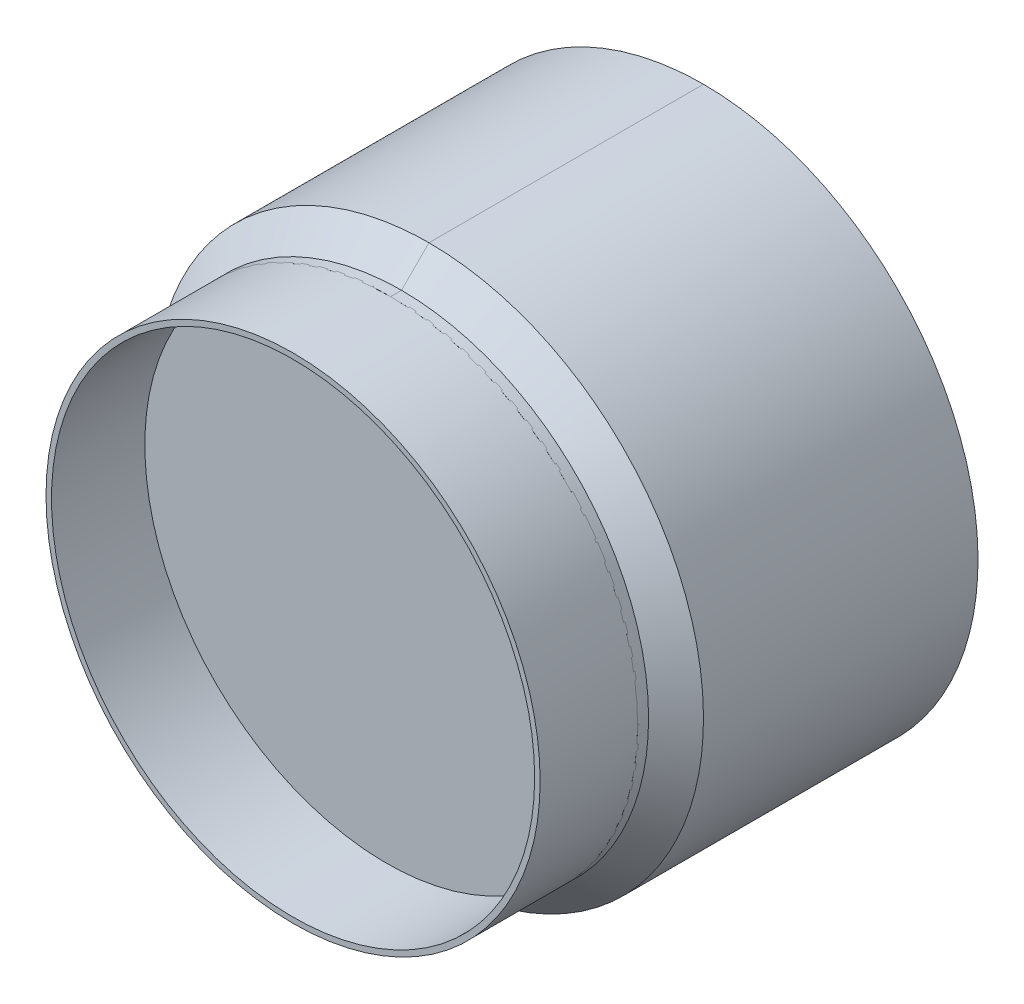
ISO-10303-21;
HEADER;
FILE_DESCRIPTION(('STEP AP214'),'2;1');
FILE_NAME('part.step','',(''),(''),'','','');
FILE_SCHEMA(('AUTOMOTIVE_DESIGN { 1 0 10303 214 1 1 1 1 }'));
ENDSEC;
DATA;
#1=APPLICATION_CONTEXT('core data for automotive mechanical design processes');
#2=APPLICATION_PROTOCOL_DEFINITION('international standard','automotive_design',2000,#1);
#3=PRODUCT_CONTEXT('',#1,'mechanical');
#4=PRODUCT('Part','Part','',(#3));
#5=PRODUCT_RELATED_PRODUCT_CATEGORY('part','',(#4));
#6=PRODUCT_DEFINITION_FORMATION('','',#4);
#7=PRODUCT_DEFINITION_CONTEXT('part definition',#1,'design');
#8=PRODUCT_DEFINITION('design','',#6,#7);
#9=PRODUCT_DEFINITION_SHAPE('','',#8);
#10=(LENGTH_UNIT() NAMED_UNIT(*) SI_UNIT(.MILLI.,.METRE.));
#11=(NAMED_UNIT(*) PLANE_ANGLE_UNIT() SI_UNIT($,.RADIAN.));
#12=(NAMED_UNIT(*) SI_UNIT($,.STERADIAN.) SOLID_ANGLE_UNIT());
#13=UNCERTAINTY_MEASURE_WITH_UNIT(LENGTH_MEASURE(1.E-05),#10,'distance_accuracy_value','');
#14=(GEOMETRIC_REPRESENTATION_CONTEXT(3) GLOBAL_UNCERTAINTY_ASSIGNED_CONTEXT((#13)) GLOBAL_UNIT_ASSIGNED_CONTEXT((#10,
#11,#12)) REPRESENTATION_CONTEXT('',''));
#15=CARTESIAN_POINT('',(0.,0.,0.));
#16=DIRECTION('',(0.,0.,1.));
#17=DIRECTION('',(1.,0.,0.));
#18=AXIS2_PLACEMENT_3D('',#15,#16,#17);
#19=CARTESIAN_POINT('',(309.000000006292,-167.99999998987,363.5));
#20=DIRECTION('',(0.,0.,-1.));
#21=DIRECTION('',(-1.,0.,0.));
#22=AXIS2_PLACEMENT_3D('',#19,#20,#21);
#23=CYLINDRICAL_SURFACE('',#22,44.9999999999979);
#24=CARTESIAN_POINT('',(309.000000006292,-167.99999998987,363.5));
#25=DIRECTION('',(0.,0.,1.));
#26=DIRECTION('',(1.,0.,0.));
#27=AXIS2_PLACEMENT_3D('',#24,#25,#26);
#28=CIRCLE('',#27,44.9999999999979);
#29=CARTESIAN_POINT('',(354.00000000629,-167.99999998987,363.5));
#30=VERTEX_POINT('',#29);
#31=EDGE_CURVE('P0_E10',#30,#30,#28,.T.);
#32=ORIENTED_EDGE('',*,*,#31,.F.);
#33=EDGE_LOOP('',(#32));
#34=FACE_BOUND('',#33,.T.);
#35=CARTESIAN_POINT('',(309.000000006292,-167.99999998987,345.5));
#36=DIRECTION('',(0.,0.,1.));
#37=DIRECTION('',(1.,0.,0.));
#38=AXIS2_PLACEMENT_3D('',#35,#36,#37);
#39=CIRCLE('',#38,44.9999999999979);
#40=CARTESIAN_POINT('',(354.00000000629,-167.99999998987,345.5));
#41=VERTEX_POINT('',#40);
#42=EDGE_CURVE('P0_E42',#41,#41,#39,.T.);
#43=ORIENTED_EDGE('',*,*,#42,.T.);
#44=EDGE_LOOP('',(#43));
#45=FACE_BOUND('',#44,.T.);
#46=ADVANCED_FACE('P0_F39',(#34,#45),#23,.T.);
#47=CARTESIAN_POINT('',(309.000000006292,-167.99999998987,363.5));
#48=DIRECTION('',(0.,0.,1.));
#49=DIRECTION('',(1.,0.,0.));
#50=AXIS2_PLACEMENT_3D('',#47,#48,#49);
#51=PLANE('',#50);
#52=CARTESIAN_POINT('',(309.000000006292,-167.99999998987,363.5));
#53=DIRECTION('',(0.,0.,1.));
#54=DIRECTION('',(1.,0.,0.));
#55=AXIS2_PLACEMENT_3D('',#52,#53,#54);
#56=CIRCLE('',#55,43.9999999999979);
#57=CARTESIAN_POINT('',(353.00000000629,-167.99999998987,363.5));
#58=VERTEX_POINT('',#57);
#59=EDGE_CURVE('P0_E49',#58,#58,#56,.T.);
#60=ORIENTED_EDGE('',*,*,#59,.F.);
#61=EDGE_LOOP('',(#60));
#62=FACE_BOUND('',#61,.T.);
#63=ORIENTED_EDGE('',*,*,#31,.T.);
#64=EDGE_LOOP('',(#63));
#65=FACE_BOUND('',#64,.T.);
#66=ADVANCED_FACE('P0_F69',(#62,#65),#51,.T.);
#67=CARTESIAN_POINT('',(309.000000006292,-167.99999998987,345.5));
#68=DIRECTION('',(0.,0.,1.));
#69=DIRECTION('',(1.,0.,0.));
#70=AXIS2_PLACEMENT_3D('',#67,#68,#69);
#71=PLANE('',#70);
#72=ORIENTED_EDGE('',*,*,#42,.F.);
#73=EDGE_LOOP('',(#72));
#74=FACE_BOUND('',#73,.T.);
#75=ADVANCED_FACE('P0_F61',(#74),#71,.F.);
#76=CARTESIAN_POINT('',(309.000000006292,-167.99999998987,363.5));
#77=DIRECTION('',(0.,0.,-1.));
#78=DIRECTION('',(-1.,0.,0.));
#79=AXIS2_PLACEMENT_3D('',#76,#77,#78);
#80=CYLINDRICAL_SURFACE('',#79,43.9999999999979);
#81=ORIENTED_EDGE('',*,*,#59,.T.);
#82=EDGE_LOOP('',(#81));
#83=FACE_BOUND('',#82,.T.);
#84=CARTESIAN_POINT('',(309.000000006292,-167.99999998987,346.5));
#85=DIRECTION('',(0.,0.,1.));
#86=DIRECTION('',(1.,0.,0.));
#87=AXIS2_PLACEMENT_3D('',#84,#85,#86);
#88=CIRCLE('',#87,43.9999999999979);
#89=CARTESIAN_POINT('',(353.00000000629,-167.99999998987,346.5));
#90=VERTEX_POINT('',#89);
#91=EDGE_CURVE('P0_E53',#90,#90,#88,.T.);
#92=ORIENTED_EDGE('',*,*,#91,.F.);
#93=EDGE_LOOP('',(#92));
#94=FACE_BOUND('',#93,.T.);
#95=ADVANCED_FACE('P0_F59',(#83,#94),#80,.F.);
#96=CARTESIAN_POINT('',(309.000000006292,-167.99999998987,346.5));
#97=DIRECTION('',(0.,0.,1.));
#98=DIRECTION('',(1.,0.,0.));
#99=AXIS2_PLACEMENT_3D('',#96,#97,#98);
#100=PLANE('',#99);
#101=ORIENTED_EDGE('',*,*,#91,.T.);
#102=EDGE_LOOP('',(#101));
#103=FACE_BOUND('',#102,.T.);
#104=ADVANCED_FACE('P0_F57',(#103),#100,.T.);
#105=CLOSED_SHELL('',(#46,#66,#75,#95,#104));
#106=MANIFOLD_SOLID_BREP('P0_B2',#105);
#107=CARTESIAN_POINT('',(309.000000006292,-122.999999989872,343.750000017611));
#108=CARTESIAN_POINT('',(354.000000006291,-122.999999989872,343.750000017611));
#109=CARTESIAN_POINT('',(354.000000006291,-167.99999998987,343.750000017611));
#110=CARTESIAN_POINT('',(354.000000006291,-212.999999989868,343.750000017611));
#111=CARTESIAN_POINT('',(309.000000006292,-212.999999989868,343.750000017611));
#112=CARTESIAN_POINT('',(309.000000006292,-122.999999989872,345.750000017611));
#113=CARTESIAN_POINT('',(354.000000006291,-122.999999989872,345.750000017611));
#114=CARTESIAN_POINT('',(354.000000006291,-167.99999998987,345.750000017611));
#115=CARTESIAN_POINT('',(354.000000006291,-212.999999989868,345.750000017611));
#116=CARTESIAN_POINT('',(309.000000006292,-212.999999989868,345.750000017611));
#117=(BOUNDED_SURFACE() B_SPLINE_SURFACE(1,2,((#107,#108,#109,#110,#111),(#112,#113,#114,#115,
#116)),.UNSPECIFIED.,.F.,.F.,.F.) B_SPLINE_SURFACE_WITH_KNOTS((2,2),(3,2,3),(30.6666666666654,
61.3333333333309),(141.371669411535,212.057504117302,282.74333882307),
.UNSPECIFIED.) GEOMETRIC_REPRESENTATION_ITEM() RATIONAL_B_SPLINE_SURFACE(((1.,0.707106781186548,
1.,0.707106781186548,1.),(1.,0.707106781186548,1.,0.707106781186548,1.))) REPRESENTATION_ITEM('') SURFACE());
#118=CARTESIAN_POINT('',(309.000000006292,-122.999999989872,343.750000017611));
#119=CARTESIAN_POINT('',(309.000000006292,-122.999999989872,345.750000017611));
#120=(BOUNDED_CURVE() B_SPLINE_CURVE(1,(#118,#119),.UNSPECIFIED.,.F.,
.F.) B_SPLINE_CURVE_WITH_KNOTS((2,2),(30.6666666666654,61.3333333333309),
.UNSPECIFIED.) CURVE() GEOMETRIC_REPRESENTATION_ITEM() RATIONAL_B_SPLINE_CURVE((1.,1.)) REPRESENTATION_ITEM(''));
#121=CARTESIAN_POINT('',(309.000000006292,-122.999999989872,343.750000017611));
#122=VERTEX_POINT('',#121);
#123=CARTESIAN_POINT('',(309.000000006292,-122.999999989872,345.750000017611));
#124=VERTEX_POINT('',#123);
#125=EDGE_CURVE('P1_E22',#122,#124,#120,.T.);
#126=CARTESIAN_POINT('',(309.000000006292,-122.999999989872,345.750000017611));
#127=CARTESIAN_POINT('',(354.000000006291,-122.999999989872,345.750000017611));
#128=CARTESIAN_POINT('',(354.000000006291,-167.99999998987,345.750000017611));
#129=CARTESIAN_POINT('',(354.000000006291,-212.999999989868,345.750000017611));
#130=CARTESIAN_POINT('',(309.000000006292,-212.999999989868,345.750000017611));
#131=(BOUNDED_CURVE() B_SPLINE_CURVE(2,(#126,#127,#128,#129,#130),.UNSPECIFIED.,.F.,
.F.) B_SPLINE_CURVE_WITH_KNOTS((3,2,3),(141.371669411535,212.057504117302,282.74333882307),
.UNSPECIFIED.) CURVE() GEOMETRIC_REPRESENTATION_ITEM() RATIONAL_B_SPLINE_CURVE((1.,
0.707106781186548,1.,0.707106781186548,1.)) REPRESENTATION_ITEM(''));
#132=CARTESIAN_POINT('',(309.000000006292,-212.999999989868,345.750000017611));
#133=VERTEX_POINT('',#132);
#134=EDGE_CURVE('P1_E30',#124,#133,#131,.T.);
#135=CARTESIAN_POINT('',(309.000000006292,-212.999999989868,343.750000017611));
#136=CARTESIAN_POINT('',(309.000000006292,-212.999999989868,345.750000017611));
#137=(BOUNDED_CURVE() B_SPLINE_CURVE(1,(#135,#136),.UNSPECIFIED.,.F.,
.F.) B_SPLINE_CURVE_WITH_KNOTS((2,2),(30.6666666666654,61.3333333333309),
.UNSPECIFIED.) CURVE() GEOMETRIC_REPRESENTATION_ITEM() RATIONAL_B_SPLINE_CURVE((1.,1.)) REPRESENTATION_ITEM(''));
#138=CARTESIAN_POINT('',(309.000000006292,-212.999999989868,343.750000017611));
#139=VERTEX_POINT('',#138);
#140=EDGE_CURVE('P1_E102',#139,#133,#137,.T.);
#141=CARTESIAN_POINT('',(309.000000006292,-122.999999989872,343.750000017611));
#142=CARTESIAN_POINT('',(354.000000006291,-122.999999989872,343.750000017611));
#143=CARTESIAN_POINT('',(354.000000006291,-167.99999998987,343.750000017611));
#144=CARTESIAN_POINT('',(354.000000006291,-212.999999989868,343.750000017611));
#145=CARTESIAN_POINT('',(309.000000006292,-212.999999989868,343.750000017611));
#146=(BOUNDED_CURVE() B_SPLINE_CURVE(2,(#141,#142,#143,#144,#145),.UNSPECIFIED.,.F.,
.F.) B_SPLINE_CURVE_WITH_KNOTS((3,2,3),(141.371669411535,212.057504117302,282.74333882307),
.UNSPECIFIED.) CURVE() GEOMETRIC_REPRESENTATION_ITEM() RATIONAL_B_SPLINE_CURVE((1.,
0.707106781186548,1.,0.707106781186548,1.)) REPRESENTATION_ITEM(''));
#147=EDGE_CURVE('P1_E11',#122,#139,#146,.T.);
#148=ORIENTED_EDGE('',*,*,#125,.T.);
#149=ORIENTED_EDGE('',*,*,#134,.T.);
#150=ORIENTED_EDGE('',*,*,#140,.F.);
#151=ORIENTED_EDGE('',*,*,#147,.F.);
#152=EDGE_LOOP('',(#148,#149,#150,#151));
#153=FACE_BOUND('',#152,.T.);
#154=ADVANCED_FACE('P1_F16',(#153),#117,.T.);
#155=CARTESIAN_POINT('',(309.000000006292,-167.99999998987,343.750000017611));
#156=CARTESIAN_POINT('',(309.000000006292,-167.99999998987,343.750000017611));
#157=CARTESIAN_POINT('',(309.000000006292,-167.99999998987,343.750000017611));
#158=CARTESIAN_POINT('',(309.000000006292,-167.99999998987,343.750000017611));
#159=CARTESIAN_POINT('',(309.000000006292,-167.99999998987,343.750000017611));
#160=CARTESIAN_POINT('',(309.000000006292,-122.999999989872,343.750000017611));
#161=CARTESIAN_POINT('',(354.000000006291,-122.999999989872,343.750000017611));
#162=CARTESIAN_POINT('',(354.000000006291,-167.99999998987,343.750000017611));
#163=CARTESIAN_POINT('',(354.000000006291,-212.999999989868,343.750000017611));
#164=CARTESIAN_POINT('',(309.000000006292,-212.999999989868,343.750000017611));
#165=(BOUNDED_SURFACE() B_SPLINE_SURFACE(1,2,((#155,#156,#157,#158,#159),(#160,#161,#162,#163,
#164)),.UNSPECIFIED.,.F.,.F.,.F.) B_SPLINE_SURFACE_WITH_KNOTS((2,2),(3,2,3),(0.,
30.6666666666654),(141.371669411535,212.057504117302,282.74333882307),
.UNSPECIFIED.) GEOMETRIC_REPRESENTATION_ITEM() RATIONAL_B_SPLINE_SURFACE(((1.,0.707106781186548,
1.,0.707106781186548,1.),(1.,0.707106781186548,1.,0.707106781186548,1.))) REPRESENTATION_ITEM('') SURFACE());
#166=CARTESIAN_POINT('',(309.000000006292,-167.99999998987,343.750000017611));
#167=CARTESIAN_POINT('',(309.000000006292,-122.999999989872,343.750000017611));
#168=(BOUNDED_CURVE() B_SPLINE_CURVE(1,(#166,#167),.UNSPECIFIED.,.F.,
.F.) B_SPLINE_CURVE_WITH_KNOTS((2,2),(0.,30.6666666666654),
.UNSPECIFIED.) CURVE() GEOMETRIC_REPRESENTATION_ITEM() RATIONAL_B_SPLINE_CURVE((1.,1.)) REPRESENTATION_ITEM(''));
#169=CARTESIAN_POINT('',(309.000000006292,-167.99999998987,343.750000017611));
#170=VERTEX_POINT('',#169);
#171=EDGE_CURVE('P1_E111',#170,#122,#168,.T.);
#172=CARTESIAN_POINT('',(309.000000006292,-167.99999998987,343.750000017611));
#173=CARTESIAN_POINT('',(309.000000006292,-212.999999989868,343.750000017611));
#174=(BOUNDED_CURVE() B_SPLINE_CURVE(1,(#172,#173),.UNSPECIFIED.,.F.,
.F.) B_SPLINE_CURVE_WITH_KNOTS((2,2),(0.,30.6666666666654),
.UNSPECIFIED.) CURVE() GEOMETRIC_REPRESENTATION_ITEM() RATIONAL_B_SPLINE_CURVE((1.,1.)) REPRESENTATION_ITEM(''));
#175=EDGE_CURVE('P1_E77',#170,#139,#174,.T.);
#176=ORIENTED_EDGE('',*,*,#171,.T.);
#177=ORIENTED_EDGE('',*,*,#147,.T.);
#178=ORIENTED_EDGE('',*,*,#175,.F.);
#179=EDGE_LOOP('',(#176,#177,#178));
#180=FACE_BOUND('',#179,.T.);
#181=ADVANCED_FACE('P1_F18',(#180),#165,.T.);
#182=CARTESIAN_POINT('',(309.000000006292,-122.999999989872,345.750000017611));
#183=CARTESIAN_POINT('',(354.000000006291,-122.999999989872,345.750000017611));
#184=CARTESIAN_POINT('',(354.000000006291,-167.99999998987,345.750000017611));
#185=CARTESIAN_POINT('',(354.000000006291,-212.999999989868,345.750000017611));
#186=CARTESIAN_POINT('',(309.000000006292,-212.999999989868,345.750000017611));
#187=CARTESIAN_POINT('',(309.000000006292,-167.99999998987,345.750000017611));
#188=CARTESIAN_POINT('',(309.000000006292,-167.99999998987,345.750000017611));
#189=CARTESIAN_POINT('',(309.000000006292,-167.99999998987,345.750000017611));
#190=CARTESIAN_POINT('',(309.000000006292,-167.99999998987,345.750000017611));
#191=CARTESIAN_POINT('',(309.000000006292,-167.99999998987,345.750000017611));
#192=(BOUNDED_SURFACE() B_SPLINE_SURFACE(1,2,((#182,#183,#184,#185,#186),(#187,#188,#189,#190,
#191)),.UNSPECIFIED.,.F.,.F.,.F.) B_SPLINE_SURFACE_WITH_KNOTS((2,2),(3,2,3),(61.3333333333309,
91.9999999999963),(141.371669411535,212.057504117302,282.74333882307),
.UNSPECIFIED.) GEOMETRIC_REPRESENTATION_ITEM() RATIONAL_B_SPLINE_SURFACE(((1.,0.707106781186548,
1.,0.707106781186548,1.),(1.,0.707106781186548,1.,0.707106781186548,1.))) REPRESENTATION_ITEM('') SURFACE());
#193=CARTESIAN_POINT('',(309.000000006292,-122.999999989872,345.750000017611));
#194=CARTESIAN_POINT('',(309.000000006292,-167.99999998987,345.750000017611));
#195=(BOUNDED_CURVE() B_SPLINE_CURVE(1,(#193,#194),.UNSPECIFIED.,.F.,
.F.) B_SPLINE_CURVE_WITH_KNOTS((2,2),(61.3333333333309,91.9999999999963),
.UNSPECIFIED.) CURVE() GEOMETRIC_REPRESENTATION_ITEM() RATIONAL_B_SPLINE_CURVE((1.,1.)) REPRESENTATION_ITEM(''));
#196=CARTESIAN_POINT('',(309.000000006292,-167.99999998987,345.750000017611));
#197=VERTEX_POINT('',#196);
#198=EDGE_CURVE('P1_E69',#124,#197,#195,.T.);
#199=CARTESIAN_POINT('',(309.000000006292,-212.999999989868,345.750000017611));
#200=CARTESIAN_POINT('',(309.000000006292,-167.99999998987,345.750000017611));
#201=(BOUNDED_CURVE() B_SPLINE_CURVE(1,(#199,#200),.UNSPECIFIED.,.F.,
.F.) B_SPLINE_CURVE_WITH_KNOTS((2,2),(61.3333333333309,91.9999999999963),
.UNSPECIFIED.) CURVE() GEOMETRIC_REPRESENTATION_ITEM() RATIONAL_B_SPLINE_CURVE((1.,1.)) REPRESENTATION_ITEM(''));
#202=EDGE_CURVE('P1_E72',#133,#197,#201,.T.);
#203=ORIENTED_EDGE('',*,*,#198,.T.);
#204=ORIENTED_EDGE('',*,*,#202,.F.);
#205=ORIENTED_EDGE('',*,*,#134,.F.);
#206=EDGE_LOOP('',(#203,#204,#205));
#207=FACE_BOUND('',#206,.T.);
#208=ADVANCED_FACE('P1_F71',(#207),#192,.T.);
#209=CARTESIAN_POINT('',(309.000000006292,-212.999999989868,343.750000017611));
#210=CARTESIAN_POINT('',(264.000000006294,-212.999999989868,343.750000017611));
#211=CARTESIAN_POINT('',(264.000000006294,-167.99999998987,343.750000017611));
#212=CARTESIAN_POINT('',(264.000000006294,-122.999999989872,343.750000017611));
#213=CARTESIAN_POINT('',(309.000000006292,-122.999999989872,343.750000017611));
#214=CARTESIAN_POINT('',(309.000000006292,-212.999999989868,345.750000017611));
#215=CARTESIAN_POINT('',(264.000000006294,-212.999999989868,345.750000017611));
#216=CARTESIAN_POINT('',(264.000000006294,-167.99999998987,345.750000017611));
#217=CARTESIAN_POINT('',(264.000000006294,-122.999999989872,345.750000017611));
#218=CARTESIAN_POINT('',(309.000000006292,-122.999999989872,345.750000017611));
#219=(BOUNDED_SURFACE() B_SPLINE_SURFACE(1,2,((#209,#210,#211,#212,#213),(#214,#215,#216,#217,
#218)),.UNSPECIFIED.,.F.,.F.,.F.) B_SPLINE_SURFACE_WITH_KNOTS((2,2),(3,2,3),(30.6666666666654,
61.3333333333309),(0.,70.6858347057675,141.371669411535),
.UNSPECIFIED.) GEOMETRIC_REPRESENTATION_ITEM() RATIONAL_B_SPLINE_SURFACE(((1.,0.707106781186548,
1.,0.707106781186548,1.),(1.,0.707106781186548,1.,0.707106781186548,1.))) REPRESENTATION_ITEM('') SURFACE());
#220=CARTESIAN_POINT('',(309.000000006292,-212.999999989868,343.750000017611));
#221=CARTESIAN_POINT('',(264.000000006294,-212.999999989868,343.750000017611));
#222=CARTESIAN_POINT('',(264.000000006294,-167.99999998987,343.750000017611));
#223=CARTESIAN_POINT('',(264.000000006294,-122.999999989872,343.750000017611));
#224=CARTESIAN_POINT('',(309.000000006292,-122.999999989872,343.750000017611));
#225=(BOUNDED_CURVE() B_SPLINE_CURVE(2,(#220,#221,#222,#223,#224),.UNSPECIFIED.,.F.,
.F.) B_SPLINE_CURVE_WITH_KNOTS((3,2,3),(0.,70.6858347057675,141.371669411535),
.UNSPECIFIED.) CURVE() GEOMETRIC_REPRESENTATION_ITEM() RATIONAL_B_SPLINE_CURVE((1.,
0.707106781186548,1.,0.707106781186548,1.)) REPRESENTATION_ITEM(''));
#226=EDGE_CURVE('P1_E101',#139,#122,#225,.T.);
#227=CARTESIAN_POINT('',(309.000000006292,-212.999999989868,345.750000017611));
#228=CARTESIAN_POINT('',(264.000000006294,-212.999999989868,345.750000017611));
#229=CARTESIAN_POINT('',(264.000000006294,-167.99999998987,345.750000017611));
#230=CARTESIAN_POINT('',(264.000000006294,-122.999999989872,345.750000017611));
#231=CARTESIAN_POINT('',(309.000000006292,-122.999999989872,345.750000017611));
#232=(BOUNDED_CURVE() B_SPLINE_CURVE(2,(#227,#228,#229,#230,#231),.UNSPECIFIED.,.F.,
.F.) B_SPLINE_CURVE_WITH_KNOTS((3,2,3),(0.,70.6858347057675,141.371669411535),
.UNSPECIFIED.) CURVE() GEOMETRIC_REPRESENTATION_ITEM() RATIONAL_B_SPLINE_CURVE((1.,
0.707106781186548,1.,0.707106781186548,1.)) REPRESENTATION_ITEM(''));
#233=EDGE_CURVE('P1_E80',#133,#124,#232,.T.);
#234=ORIENTED_EDGE('',*,*,#226,.F.);
#235=ORIENTED_EDGE('',*,*,#140,.T.);
#236=ORIENTED_EDGE('',*,*,#233,.T.);
#237=ORIENTED_EDGE('',*,*,#125,.F.);
#238=EDGE_LOOP('',(#234,#235,#236,#237));
#239=FACE_BOUND('',#238,.T.);
#240=ADVANCED_FACE('P1_F151',(#239),#219,.T.);
#241=CARTESIAN_POINT('',(309.000000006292,-167.99999998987,343.750000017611));
#242=CARTESIAN_POINT('',(309.000000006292,-167.99999998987,343.750000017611));
#243=CARTESIAN_POINT('',(309.000000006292,-167.99999998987,343.750000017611));
#244=CARTESIAN_POINT('',(309.000000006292,-167.99999998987,343.750000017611));
#245=CARTESIAN_POINT('',(309.000000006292,-167.99999998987,343.750000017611));
#246=CARTESIAN_POINT('',(309.000000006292,-212.999999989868,343.750000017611));
#247=CARTESIAN_POINT('',(264.000000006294,-212.999999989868,343.750000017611));
#248=CARTESIAN_POINT('',(264.000000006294,-167.99999998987,343.750000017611));
#249=CARTESIAN_POINT('',(264.000000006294,-122.999999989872,343.750000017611));
#250=CARTESIAN_POINT('',(309.000000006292,-122.999999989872,343.750000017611));
#251=(BOUNDED_SURFACE() B_SPLINE_SURFACE(1,2,((#241,#242,#243,#244,#245),(#246,#247,#248,#249,
#250)),.UNSPECIFIED.,.F.,.F.,.F.) B_SPLINE_SURFACE_WITH_KNOTS((2,2),(3,2,3),(0.,
30.6666666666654),(0.,70.6858347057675,141.371669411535),
.UNSPECIFIED.) GEOMETRIC_REPRESENTATION_ITEM() RATIONAL_B_SPLINE_SURFACE(((1.,0.707106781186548,
1.,0.707106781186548,1.),(1.,0.707106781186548,1.,0.707106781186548,1.))) REPRESENTATION_ITEM('') SURFACE());
#252=ORIENTED_EDGE('',*,*,#175,.T.);
#253=ORIENTED_EDGE('',*,*,#226,.T.);
#254=ORIENTED_EDGE('',*,*,#171,.F.);
#255=EDGE_LOOP('',(#252,#253,#254));
#256=FACE_BOUND('',#255,.T.);
#257=ADVANCED_FACE('P1_F149',(#256),#251,.T.);
#258=CARTESIAN_POINT('',(309.000000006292,-212.999999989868,345.750000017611));
#259=CARTESIAN_POINT('',(264.000000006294,-212.999999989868,345.750000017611));
#260=CARTESIAN_POINT('',(264.000000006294,-167.99999998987,345.750000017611));
#261=CARTESIAN_POINT('',(264.000000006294,-122.999999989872,345.750000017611));
#262=CARTESIAN_POINT('',(309.000000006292,-122.999999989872,345.750000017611));
#263=CARTESIAN_POINT('',(309.000000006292,-167.99999998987,345.750000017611));
#264=CARTESIAN_POINT('',(309.000000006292,-167.99999998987,345.750000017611));
#265=CARTESIAN_POINT('',(309.000000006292,-167.99999998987,345.750000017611));
#266=CARTESIAN_POINT('',(309.000000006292,-167.99999998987,345.750000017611));
#267=CARTESIAN_POINT('',(309.000000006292,-167.99999998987,345.750000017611));
#268=(BOUNDED_SURFACE() B_SPLINE_SURFACE(1,2,((#258,#259,#260,#261,#262),(#263,#264,#265,#266,
#267)),.UNSPECIFIED.,.F.,.F.,.F.) B_SPLINE_SURFACE_WITH_KNOTS((2,2),(3,2,3),(61.3333333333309,
91.9999999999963),(0.,70.6858347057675,141.371669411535),
.UNSPECIFIED.) GEOMETRIC_REPRESENTATION_ITEM() RATIONAL_B_SPLINE_SURFACE(((1.,0.707106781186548,
1.,0.707106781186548,1.),(1.,0.707106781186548,1.,0.707106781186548,1.))) REPRESENTATION_ITEM('') SURFACE());
#269=ORIENTED_EDGE('',*,*,#233,.F.);
#270=ORIENTED_EDGE('',*,*,#202,.T.);
#271=ORIENTED_EDGE('',*,*,#198,.F.);
#272=EDGE_LOOP('',(#269,#270,#271));
#273=FACE_BOUND('',#272,.T.);
#274=ADVANCED_FACE('P1_F79',(#273),#268,.T.);
#275=CLOSED_SHELL('',(#154,#181,#208,#240,#257,#274));
#276=MANIFOLD_SOLID_BREP('P1_B1',#275);
#277=CARTESIAN_POINT('',(309.000000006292,-127.99999997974,288.750000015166));
#278=CARTESIAN_POINT('',(309.000000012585,-127.99999997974,332.));
#279=CARTESIAN_POINT('',(349.000000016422,-127.99999997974,288.750000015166));
#280=CARTESIAN_POINT('',(349.000000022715,-127.999999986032,331.999999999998));
#281=CARTESIAN_POINT('',(349.000000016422,-167.99999998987,288.750000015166));
#282=CARTESIAN_POINT('',(349.000000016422,-167.999999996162,332.));
#283=CARTESIAN_POINT('',(349.000000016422,-208.,288.750000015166));
#284=CARTESIAN_POINT('',(349.00000001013,-208.000000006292,331.999999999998));
#285=CARTESIAN_POINT('',(309.000000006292,-208.,288.750000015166));
#286=CARTESIAN_POINT('',(309.,-208.,332.));
#287=(BOUNDED_SURFACE() B_SPLINE_SURFACE(2,1,((#277,#278),(#279,#280),(#281,#282),(#283,#284),
(#285,#286)),.UNSPECIFIED.,.F.,.F.,.F.) B_SPLINE_SURFACE_WITH_KNOTS((3,2,3),(2,2),
(157.07963267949,235.619449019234,314.159265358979),(130.214045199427,162.767556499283),
.UNSPECIFIED.) GEOMETRIC_REPRESENTATION_ITEM() RATIONAL_B_SPLINE_SURFACE(((1.,1.),
(0.707106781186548,0.707106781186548),(1.,1.),(0.707106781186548,0.707106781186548),(1.,1.))) REPRESENTATION_ITEM('') SURFACE());
#288=CARTESIAN_POINT('',(309.000000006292,-127.99999997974,288.750000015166));
#289=CARTESIAN_POINT('',(349.000000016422,-127.99999997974,288.750000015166));
#290=CARTESIAN_POINT('',(349.000000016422,-167.99999998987,288.750000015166));
#291=CARTESIAN_POINT('',(349.000000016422,-208.,288.750000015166));
#292=CARTESIAN_POINT('',(309.000000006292,-208.,288.750000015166));
#293=(BOUNDED_CURVE() B_SPLINE_CURVE(2,(#288,#289,#290,#291,#292),.UNSPECIFIED.,.F.,
.F.) B_SPLINE_CURVE_WITH_KNOTS((3,2,3),(157.07963267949,235.619449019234,314.159265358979),
.UNSPECIFIED.) CURVE() GEOMETRIC_REPRESENTATION_ITEM() RATIONAL_B_SPLINE_CURVE((1.,
0.707106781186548,1.,0.707106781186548,1.)) REPRESENTATION_ITEM(''));
#294=CARTESIAN_POINT('',(309.000000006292,-127.99999997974,288.750000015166));
#295=VERTEX_POINT('',#294);
#296=CARTESIAN_POINT('',(309.000000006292,-208.,288.750000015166));
#297=VERTEX_POINT('',#296);
#298=EDGE_CURVE('P2_E11',#295,#297,#293,.T.);
#299=CARTESIAN_POINT('',(309.000000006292,-208.,288.750000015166));
#300=CARTESIAN_POINT('',(309.,-208.,332.));
#301=(BOUNDED_CURVE() B_SPLINE_CURVE(1,(#299,#300),.UNSPECIFIED.,.F.,
.F.) B_SPLINE_CURVE_WITH_KNOTS((2,2),(130.214045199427,162.767556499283),
.UNSPECIFIED.) CURVE() GEOMETRIC_REPRESENTATION_ITEM() RATIONAL_B_SPLINE_CURVE((1.,1.)) REPRESENTATION_ITEM(''));
#302=CARTESIAN_POINT('',(309.,-208.,332.));
#303=VERTEX_POINT('',#302);
#304=EDGE_CURVE('P2_E128',#297,#303,#301,.T.);
#305=CARTESIAN_POINT('',(309.000000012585,-127.99999997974,332.));
#306=CARTESIAN_POINT('',(349.000000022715,-127.999999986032,331.999999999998));
#307=CARTESIAN_POINT('',(349.000000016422,-167.999999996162,332.));
#308=CARTESIAN_POINT('',(349.00000001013,-208.000000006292,331.999999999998));
#309=CARTESIAN_POINT('',(309.,-208.,332.));
#310=(BOUNDED_CURVE() B_SPLINE_CURVE(2,(#305,#306,#307,#308,#309),.UNSPECIFIED.,.F.,
.F.) B_SPLINE_CURVE_WITH_KNOTS((3,2,3),(157.07963267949,235.619449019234,314.159265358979),
.UNSPECIFIED.) CURVE() GEOMETRIC_REPRESENTATION_ITEM() RATIONAL_B_SPLINE_CURVE((1.,
0.707106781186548,1.,0.707106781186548,1.)) REPRESENTATION_ITEM(''));
#311=CARTESIAN_POINT('',(309.000000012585,-127.99999997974,332.));
#312=VERTEX_POINT('',#311);
#313=EDGE_CURVE('P2_E136',#312,#303,#310,.T.);
#314=CARTESIAN_POINT('',(309.000000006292,-127.99999997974,288.750000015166));
#315=CARTESIAN_POINT('',(309.000000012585,-127.99999997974,332.));
#316=(BOUNDED_CURVE() B_SPLINE_CURVE(1,(#314,#315),.UNSPECIFIED.,.F.,
.F.) B_SPLINE_CURVE_WITH_KNOTS((2,2),(130.214045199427,162.767556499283),
.UNSPECIFIED.) CURVE() GEOMETRIC_REPRESENTATION_ITEM() RATIONAL_B_SPLINE_CURVE((1.,1.)) REPRESENTATION_ITEM(''));
#317=EDGE_CURVE('P2_E137',#295,#312,#316,.T.);
#318=ORIENTED_EDGE('',*,*,#298,.T.);
#319=ORIENTED_EDGE('',*,*,#304,.T.);
#320=ORIENTED_EDGE('',*,*,#313,.F.);
#321=ORIENTED_EDGE('',*,*,#317,.F.);
#322=EDGE_LOOP('',(#318,#319,#320,#321));
#323=FACE_BOUND('',#322,.T.);
#324=ADVANCED_FACE('P2_F16',(#323),#287,.T.);
#325=CARTESIAN_POINT('',(309.000000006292,-117.99999998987,288.750000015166));
#326=CARTESIAN_POINT('',(309.000000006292,-127.99999997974,288.750000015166));
#327=CARTESIAN_POINT('',(359.000000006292,-117.99999998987,288.750000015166));
#328=CARTESIAN_POINT('',(349.000000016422,-127.99999997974,288.750000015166));
#329=CARTESIAN_POINT('',(359.000000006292,-167.99999998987,288.750000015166));
#330=CARTESIAN_POINT('',(349.000000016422,-167.99999998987,288.750000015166));
#331=CARTESIAN_POINT('',(359.000000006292,-217.99999998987,288.750000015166));
#332=CARTESIAN_POINT('',(349.000000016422,-208.,288.750000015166));
#333=CARTESIAN_POINT('',(309.000000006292,-217.99999998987,288.750000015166));
#334=CARTESIAN_POINT('',(309.000000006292,-208.,288.750000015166));
#335=(BOUNDED_SURFACE() B_SPLINE_SURFACE(2,1,((#325,#326),(#327,#328),(#329,#330),(#331,#332),
(#333,#334)),.UNSPECIFIED.,.F.,.F.,.F.) B_SPLINE_SURFACE_WITH_KNOTS((3,2,3),(2,2),
(157.07963267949,235.619449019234,314.159265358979),(97.6605338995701,130.214045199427),
.UNSPECIFIED.) GEOMETRIC_REPRESENTATION_ITEM() RATIONAL_B_SPLINE_SURFACE(((1.,1.),
(0.707106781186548,0.707106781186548),(1.,1.),(0.707106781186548,0.707106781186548),(1.,1.))) REPRESENTATION_ITEM('') SURFACE());
#336=CARTESIAN_POINT('',(309.000000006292,-117.99999998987,288.750000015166));
#337=CARTESIAN_POINT('',(359.000000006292,-117.99999998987,288.750000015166));
#338=CARTESIAN_POINT('',(359.000000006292,-167.99999998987,288.750000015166));
#339=CARTESIAN_POINT('',(359.000000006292,-217.99999998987,288.750000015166));
#340=CARTESIAN_POINT('',(309.000000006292,-217.99999998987,288.750000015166));
#341=(BOUNDED_CURVE() B_SPLINE_CURVE(2,(#336,#337,#338,#339,#340),.UNSPECIFIED.,.F.,
.F.) B_SPLINE_CURVE_WITH_KNOTS((3,2,3),(157.07963267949,235.619449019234,314.159265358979),
.UNSPECIFIED.) CURVE() GEOMETRIC_REPRESENTATION_ITEM() RATIONAL_B_SPLINE_CURVE((1.,
0.707106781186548,1.,0.707106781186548,1.)) REPRESENTATION_ITEM(''));
#342=CARTESIAN_POINT('',(309.000000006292,-117.99999998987,288.750000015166));
#343=VERTEX_POINT('',#342);
#344=CARTESIAN_POINT('',(309.000000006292,-217.99999998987,288.750000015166));
#345=VERTEX_POINT('',#344);
#346=EDGE_CURVE('P2_E31',#343,#345,#341,.T.);
#347=CARTESIAN_POINT('',(309.000000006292,-217.99999998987,288.750000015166));
#348=CARTESIAN_POINT('',(309.000000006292,-208.,288.750000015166));
#349=(BOUNDED_CURVE() B_SPLINE_CURVE(1,(#347,#348),.UNSPECIFIED.,.F.,
.F.) B_SPLINE_CURVE_WITH_KNOTS((2,2),(97.6605338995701,130.214045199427),
.UNSPECIFIED.) CURVE() GEOMETRIC_REPRESENTATION_ITEM() RATIONAL_B_SPLINE_CURVE((1.,1.)) REPRESENTATION_ITEM(''));
#350=EDGE_CURVE('P2_E192',#345,#297,#349,.T.);
#351=CARTESIAN_POINT('',(309.000000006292,-117.99999998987,288.750000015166));
#352=CARTESIAN_POINT('',(309.000000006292,-127.99999997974,288.750000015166));
#353=(BOUNDED_CURVE() B_SPLINE_CURVE(1,(#351,#352),.UNSPECIFIED.,.F.,
.F.) B_SPLINE_CURVE_WITH_KNOTS((2,2),(97.6605338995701,130.214045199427),
.UNSPECIFIED.) CURVE() GEOMETRIC_REPRESENTATION_ITEM() RATIONAL_B_SPLINE_CURVE((1.,1.)) REPRESENTATION_ITEM(''));
#354=EDGE_CURVE('P2_E146',#343,#295,#353,.T.);
#355=ORIENTED_EDGE('',*,*,#346,.T.);
#356=ORIENTED_EDGE('',*,*,#350,.T.);
#357=ORIENTED_EDGE('',*,*,#298,.F.);
#358=ORIENTED_EDGE('',*,*,#354,.F.);
#359=EDGE_LOOP('',(#355,#356,#357,#358));
#360=FACE_BOUND('',#359,.T.);
#361=ADVANCED_FACE('P2_F295',(#360),#335,.T.);
#362=CARTESIAN_POINT('',(309.000000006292,-117.999999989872,338.750000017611));
#363=CARTESIAN_POINT('',(309.000000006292,-117.99999998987,288.750000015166));
#364=CARTESIAN_POINT('',(359.000000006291,-117.999999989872,338.750000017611));
#365=CARTESIAN_POINT('',(359.000000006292,-117.99999998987,288.750000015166));
#366=CARTESIAN_POINT('',(359.000000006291,-167.99999998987,338.750000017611));
#367=CARTESIAN_POINT('',(359.000000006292,-167.99999998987,288.750000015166));
#368=CARTESIAN_POINT('',(359.000000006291,-217.999999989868,338.750000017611));
#369=CARTESIAN_POINT('',(359.000000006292,-217.99999998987,288.750000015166));
#370=CARTESIAN_POINT('',(309.000000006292,-217.999999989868,338.750000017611));
#371=CARTESIAN_POINT('',(309.000000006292,-217.99999998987,288.750000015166));
#372=(BOUNDED_SURFACE() B_SPLINE_SURFACE(2,1,((#362,#363),(#364,#365),(#366,#367),(#368,#369),
(#370,#371)),.UNSPECIFIED.,.F.,.F.,.F.) B_SPLINE_SURFACE_WITH_KNOTS((3,2,3),(2,2),
(157.07963267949,235.619449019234,314.159265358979),(65.1070225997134,97.6605338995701),
.UNSPECIFIED.) GEOMETRIC_REPRESENTATION_ITEM() RATIONAL_B_SPLINE_SURFACE(((1.,1.),
(0.707106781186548,0.707106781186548),(1.,1.),(0.707106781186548,0.707106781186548),(1.,1.))) REPRESENTATION_ITEM('') SURFACE());
#373=CARTESIAN_POINT('',(309.000000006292,-117.999999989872,338.750000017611));
#374=CARTESIAN_POINT('',(359.00000000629,-117.999999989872,338.750000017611));
#375=CARTESIAN_POINT('',(359.000000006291,-167.99999998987,338.750000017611));
#376=CARTESIAN_POINT('',(359.00000000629,-217.999999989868,338.750000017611));
#377=CARTESIAN_POINT('',(309.000000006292,-217.999999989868,338.750000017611));
#378=(BOUNDED_CURVE() B_SPLINE_CURVE(2,(#373,#374,#375,#376,#377),.UNSPECIFIED.,.F.,
.F.) B_SPLINE_CURVE_WITH_KNOTS((3,2,3),(157.07963267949,235.619449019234,314.159265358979),
.UNSPECIFIED.) CURVE() GEOMETRIC_REPRESENTATION_ITEM() RATIONAL_B_SPLINE_CURVE((1.,
0.707106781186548,1.,0.707106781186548,1.)) REPRESENTATION_ITEM(''));
#379=CARTESIAN_POINT('',(309.000000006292,-117.999999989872,338.750000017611));
#380=VERTEX_POINT('',#379);
#381=CARTESIAN_POINT('',(309.000000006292,-217.999999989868,338.750000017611));
#382=VERTEX_POINT('',#381);
#383=EDGE_CURVE('P2_E75',#380,#382,#378,.T.);
#384=CARTESIAN_POINT('',(309.000000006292,-217.999999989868,338.750000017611));
#385=CARTESIAN_POINT('',(309.000000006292,-217.99999998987,288.750000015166));
#386=(BOUNDED_CURVE() B_SPLINE_CURVE(1,(#384,#385),.UNSPECIFIED.,.F.,
.F.) B_SPLINE_CURVE_WITH_KNOTS((2,2),(65.1070225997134,97.6605338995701),
.UNSPECIFIED.) CURVE() GEOMETRIC_REPRESENTATION_ITEM() RATIONAL_B_SPLINE_CURVE((1.,1.)) REPRESENTATION_ITEM(''));
#387=EDGE_CURVE('P2_E138',#382,#345,#386,.T.);
#388=CARTESIAN_POINT('',(309.000000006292,-117.999999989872,338.750000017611));
#389=CARTESIAN_POINT('',(309.000000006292,-117.99999998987,288.750000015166));
#390=(BOUNDED_CURVE() B_SPLINE_CURVE(1,(#388,#389),.UNSPECIFIED.,.F.,
.F.) B_SPLINE_CURVE_WITH_KNOTS((2,2),(65.1070225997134,97.6605338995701),
.UNSPECIFIED.) CURVE() GEOMETRIC_REPRESENTATION_ITEM() RATIONAL_B_SPLINE_CURVE((1.,1.)) REPRESENTATION_ITEM(''));
#391=EDGE_CURVE('P2_E185',#380,#343,#390,.T.);
#392=ORIENTED_EDGE('',*,*,#383,.T.);
#393=ORIENTED_EDGE('',*,*,#387,.T.);
#394=ORIENTED_EDGE('',*,*,#346,.F.);
#395=ORIENTED_EDGE('',*,*,#391,.F.);
#396=EDGE_LOOP('',(#392,#393,#394,#395));
#397=FACE_BOUND('',#396,.T.);
#398=ADVANCED_FACE('P2_F302',(#397),#372,.T.);
#399=CARTESIAN_POINT('',(309.000000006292,-122.999999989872,343.750000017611));
#400=CARTESIAN_POINT('',(309.000000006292,-117.999999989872,338.750000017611));
#401=CARTESIAN_POINT('',(354.000000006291,-122.999999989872,343.750000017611));
#402=CARTESIAN_POINT('',(359.000000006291,-117.999999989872,338.750000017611));
#403=CARTESIAN_POINT('',(354.000000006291,-167.99999998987,343.750000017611));
#404=CARTESIAN_POINT('',(359.000000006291,-167.99999998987,338.750000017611));
#405=CARTESIAN_POINT('',(354.000000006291,-212.999999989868,343.750000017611));
#406=CARTESIAN_POINT('',(359.000000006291,-217.999999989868,338.750000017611));
#407=CARTESIAN_POINT('',(309.000000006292,-212.999999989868,343.750000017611));
#408=CARTESIAN_POINT('',(309.000000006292,-217.999999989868,338.750000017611));
#409=(BOUNDED_SURFACE() B_SPLINE_SURFACE(2,1,((#399,#400),(#401,#402),(#403,#404),(#405,#406),
(#407,#408)),.UNSPECIFIED.,.F.,.F.,.F.) B_SPLINE_SURFACE_WITH_KNOTS((3,2,3),(2,2),
(157.07963267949,235.619449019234,314.159265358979),(32.5535112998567,65.1070225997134),
.UNSPECIFIED.) GEOMETRIC_REPRESENTATION_ITEM() RATIONAL_B_SPLINE_SURFACE(((1.,1.),
(0.707106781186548,0.707106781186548),(1.,1.),(0.707106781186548,0.707106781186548),(1.,1.))) REPRESENTATION_ITEM('') SURFACE());
#410=CARTESIAN_POINT('',(309.000000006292,-122.999999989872,343.750000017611));
#411=CARTESIAN_POINT('',(354.000000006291,-122.999999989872,343.750000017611));
#412=CARTESIAN_POINT('',(354.000000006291,-167.99999998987,343.750000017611));
#413=CARTESIAN_POINT('',(354.000000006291,-212.999999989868,343.750000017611));
#414=CARTESIAN_POINT('',(309.000000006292,-212.999999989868,343.750000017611));
#415=(BOUNDED_CURVE() B_SPLINE_CURVE(2,(#410,#411,#412,#413,#414),.UNSPECIFIED.,.F.,
.F.) B_SPLINE_CURVE_WITH_KNOTS((3,2,3),(157.07963267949,235.619449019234,314.159265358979),
.UNSPECIFIED.) CURVE() GEOMETRIC_REPRESENTATION_ITEM() RATIONAL_B_SPLINE_CURVE((1.,
0.707106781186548,1.,0.707106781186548,1.)) REPRESENTATION_ITEM(''));
#416=CARTESIAN_POINT('',(309.000000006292,-122.999999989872,343.750000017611));
#417=VERTEX_POINT('',#416);
#418=CARTESIAN_POINT('',(309.000000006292,-212.999999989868,343.750000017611));
#419=VERTEX_POINT('',#418);
#420=EDGE_CURVE('P2_E94',#417,#419,#415,.T.);
#421=CARTESIAN_POINT('',(309.000000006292,-212.999999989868,343.750000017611));
#422=CARTESIAN_POINT('',(309.000000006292,-217.999999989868,338.750000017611));
#423=(BOUNDED_CURVE() B_SPLINE_CURVE(1,(#421,#422),.UNSPECIFIED.,.F.,
.F.) B_SPLINE_CURVE_WITH_KNOTS((2,2),(32.5535112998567,65.1070225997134),
.UNSPECIFIED.) CURVE() GEOMETRIC_REPRESENTATION_ITEM() RATIONAL_B_SPLINE_CURVE((1.,1.)) REPRESENTATION_ITEM(''));
#424=EDGE_CURVE('P2_E22',#419,#382,#423,.T.);
#425=CARTESIAN_POINT('',(309.000000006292,-122.999999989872,343.750000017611));
#426=CARTESIAN_POINT('',(309.000000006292,-117.999999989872,338.750000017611));
#427=(BOUNDED_CURVE() B_SPLINE_CURVE(1,(#425,#426),.UNSPECIFIED.,.F.,
.F.) B_SPLINE_CURVE_WITH_KNOTS((2,2),(32.5535112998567,65.1070225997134),
.UNSPECIFIED.) CURVE() GEOMETRIC_REPRESENTATION_ITEM() RATIONAL_B_SPLINE_CURVE((1.,1.)) REPRESENTATION_ITEM(''));
#428=EDGE_CURVE('P2_E112',#417,#380,#427,.T.);
#429=ORIENTED_EDGE('',*,*,#420,.T.);
#430=ORIENTED_EDGE('',*,*,#424,.T.);
#431=ORIENTED_EDGE('',*,*,#383,.F.);
#432=ORIENTED_EDGE('',*,*,#428,.F.);
#433=EDGE_LOOP('',(#429,#430,#431,#432));
#434=FACE_BOUND('',#433,.T.);
#435=ADVANCED_FACE('P2_F304',(#434),#409,.T.);
#436=CARTESIAN_POINT('',(309.000000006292,-167.99999998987,343.750000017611));
#437=CARTESIAN_POINT('',(309.000000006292,-122.999999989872,343.750000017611));
#438=CARTESIAN_POINT('',(309.000000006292,-167.99999998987,343.750000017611));
#439=CARTESIAN_POINT('',(354.000000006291,-122.999999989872,343.750000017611));
#440=CARTESIAN_POINT('',(309.000000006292,-167.99999998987,343.750000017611));
#441=CARTESIAN_POINT('',(354.000000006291,-167.99999998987,343.750000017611));
#442=CARTESIAN_POINT('',(309.000000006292,-167.99999998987,343.750000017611));
#443=CARTESIAN_POINT('',(354.000000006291,-212.999999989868,343.750000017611));
#444=CARTESIAN_POINT('',(309.000000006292,-167.99999998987,343.750000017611));
#445=CARTESIAN_POINT('',(309.000000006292,-212.999999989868,343.750000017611));
#446=(BOUNDED_SURFACE() B_SPLINE_SURFACE(2,1,((#436,#437),(#438,#439),(#440,#441),(#442,#443),
(#444,#445)),.UNSPECIFIED.,.F.,.F.,.F.) B_SPLINE_SURFACE_WITH_KNOTS((3,2,3),(2,2),
(157.07963267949,235.619449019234,314.159265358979),(0.,32.5535112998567),
.UNSPECIFIED.) GEOMETRIC_REPRESENTATION_ITEM() RATIONAL_B_SPLINE_SURFACE(((1.,1.),
(0.707106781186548,0.707106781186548),(1.,1.),(0.707106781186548,0.707106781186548),(1.,1.))) REPRESENTATION_ITEM('') SURFACE());
#447=CARTESIAN_POINT('',(309.000000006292,-167.99999998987,343.750000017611));
#448=CARTESIAN_POINT('',(309.000000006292,-212.999999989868,343.750000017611));
#449=(BOUNDED_CURVE() B_SPLINE_CURVE(1,(#447,#448),.UNSPECIFIED.,.F.,
.F.) B_SPLINE_CURVE_WITH_KNOTS((2,2),(0.,32.5535112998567),
.UNSPECIFIED.) CURVE() GEOMETRIC_REPRESENTATION_ITEM() RATIONAL_B_SPLINE_CURVE((1.,1.)) REPRESENTATION_ITEM(''));
#450=CARTESIAN_POINT('',(309.000000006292,-167.99999998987,343.750000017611));
#451=VERTEX_POINT('',#450);
#452=EDGE_CURVE('P2_E106',#451,#419,#449,.T.);
#453=CARTESIAN_POINT('',(309.000000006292,-167.99999998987,343.750000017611));
#454=CARTESIAN_POINT('',(309.000000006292,-122.999999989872,343.750000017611));
#455=(BOUNDED_CURVE() B_SPLINE_CURVE(1,(#453,#454),.UNSPECIFIED.,.F.,
.F.) B_SPLINE_CURVE_WITH_KNOTS((2,2),(0.,32.5535112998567),
.UNSPECIFIED.) CURVE() GEOMETRIC_REPRESENTATION_ITEM() RATIONAL_B_SPLINE_CURVE((1.,1.)) REPRESENTATION_ITEM(''));
#456=EDGE_CURVE('P2_E108',#451,#417,#455,.T.);
#457=ORIENTED_EDGE('',*,*,#452,.T.);
#458=ORIENTED_EDGE('',*,*,#420,.F.);
#459=ORIENTED_EDGE('',*,*,#456,.F.);
#460=EDGE_LOOP('',(#457,#458,#459));
#461=FACE_BOUND('',#460,.T.);
#462=ADVANCED_FACE('P2_F114',(#461),#446,.T.);
#463=CARTESIAN_POINT('',(309.000000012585,-127.99999997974,332.));
#464=CARTESIAN_POINT('',(309.000000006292,-167.99999998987,332.));
#465=CARTESIAN_POINT('',(349.000000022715,-127.999999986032,331.999999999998));
#466=CARTESIAN_POINT('',(309.000000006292,-167.99999998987,331.999999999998));
#467=CARTESIAN_POINT('',(349.000000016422,-167.999999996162,332.));
#468=CARTESIAN_POINT('',(309.000000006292,-167.99999998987,332.));
#469=CARTESIAN_POINT('',(349.00000001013,-208.000000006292,331.999999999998));
#470=CARTESIAN_POINT('',(309.000000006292,-167.99999998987,331.999999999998));
#471=CARTESIAN_POINT('',(309.,-208.,332.));
#472=CARTESIAN_POINT('',(309.000000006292,-167.99999998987,332.));
#473=(BOUNDED_SURFACE() B_SPLINE_SURFACE(2,1,((#463,#464),(#465,#466),(#467,#468),(#469,#470),
(#471,#472)),.UNSPECIFIED.,.F.,.F.,.F.) B_SPLINE_SURFACE_WITH_KNOTS((3,2,3),(2,2),
(157.07963267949,235.619449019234,314.159265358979),(162.767556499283,195.32106779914),
.UNSPECIFIED.) GEOMETRIC_REPRESENTATION_ITEM() RATIONAL_B_SPLINE_SURFACE(((1.,1.),
(0.707106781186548,0.707106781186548),(1.,1.),(0.707106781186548,0.707106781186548),(1.,1.))) REPRESENTATION_ITEM('') SURFACE());
#474=CARTESIAN_POINT('',(309.,-208.,332.));
#475=CARTESIAN_POINT('',(309.000000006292,-167.99999998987,332.));
#476=(BOUNDED_CURVE() B_SPLINE_CURVE(1,(#474,#475),.UNSPECIFIED.,.F.,
.F.) B_SPLINE_CURVE_WITH_KNOTS((2,2),(162.767556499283,195.32106779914),
.UNSPECIFIED.) CURVE() GEOMETRIC_REPRESENTATION_ITEM() RATIONAL_B_SPLINE_CURVE((1.,1.)) REPRESENTATION_ITEM(''));
#477=CARTESIAN_POINT('',(309.000000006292,-167.99999998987,332.));
#478=VERTEX_POINT('',#477);
#479=EDGE_CURVE('P2_E123',#303,#478,#476,.T.);
#480=CARTESIAN_POINT('',(309.000000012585,-127.99999997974,332.));
#481=CARTESIAN_POINT('',(309.000000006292,-167.99999998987,332.));
#482=(BOUNDED_CURVE() B_SPLINE_CURVE(1,(#480,#481),.UNSPECIFIED.,.F.,
.F.) B_SPLINE_CURVE_WITH_KNOTS((2,2),(162.767556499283,195.32106779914),
.UNSPECIFIED.) CURVE() GEOMETRIC_REPRESENTATION_ITEM() RATIONAL_B_SPLINE_CURVE((1.,1.)) REPRESENTATION_ITEM(''));
#483=EDGE_CURVE('P2_E241',#312,#478,#482,.T.);
#484=ORIENTED_EDGE('',*,*,#313,.T.);
#485=ORIENTED_EDGE('',*,*,#479,.T.);
#486=ORIENTED_EDGE('',*,*,#483,.F.);
#487=EDGE_LOOP('',(#484,#485,#486));
#488=FACE_BOUND('',#487,.T.);
#489=ADVANCED_FACE('P2_F292',(#488),#473,.T.);
#490=CARTESIAN_POINT('',(309.000000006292,-208.,288.750000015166));
#491=CARTESIAN_POINT('',(309.,-208.,332.));
#492=CARTESIAN_POINT('',(268.999999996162,-208.,288.750000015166));
#493=CARTESIAN_POINT('',(268.99999998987,-207.999999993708,331.999999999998));
#494=CARTESIAN_POINT('',(268.999999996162,-167.99999998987,288.750000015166));
#495=CARTESIAN_POINT('',(268.999999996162,-167.999999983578,332.));
#496=CARTESIAN_POINT('',(268.999999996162,-127.99999997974,288.750000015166));
#497=CARTESIAN_POINT('',(269.000000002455,-127.999999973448,331.999999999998));
#498=CARTESIAN_POINT('',(309.000000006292,-127.99999997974,288.750000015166));
#499=CARTESIAN_POINT('',(309.000000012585,-127.99999997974,332.));
#500=(BOUNDED_SURFACE() B_SPLINE_SURFACE(2,1,((#490,#491),(#492,#493),(#494,#495),(#496,#497),
(#498,#499)),.UNSPECIFIED.,.F.,.F.,.F.) B_SPLINE_SURFACE_WITH_KNOTS((3,2,3),(2,2),(0.,
78.5398163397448,157.07963267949),(130.214045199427,162.767556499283),
.UNSPECIFIED.) GEOMETRIC_REPRESENTATION_ITEM() RATIONAL_B_SPLINE_SURFACE(((1.,1.),
(0.707106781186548,0.707106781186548),(1.,1.),(0.707106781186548,0.707106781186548),(1.,1.))) REPRESENTATION_ITEM('') SURFACE());
#501=CARTESIAN_POINT('',(309.,-208.,332.));
#502=CARTESIAN_POINT('',(268.99999998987,-207.999999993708,331.999999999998));
#503=CARTESIAN_POINT('',(268.999999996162,-167.999999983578,332.));
#504=CARTESIAN_POINT('',(269.000000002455,-127.999999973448,331.999999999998));
#505=CARTESIAN_POINT('',(309.000000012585,-127.99999997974,332.));
#506=(BOUNDED_CURVE() B_SPLINE_CURVE(2,(#501,#502,#503,#504,#505),.UNSPECIFIED.,.F.,
.F.) B_SPLINE_CURVE_WITH_KNOTS((3,2,3),(0.,78.5398163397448,157.07963267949),
.UNSPECIFIED.) CURVE() GEOMETRIC_REPRESENTATION_ITEM() RATIONAL_B_SPLINE_CURVE((1.,
0.707106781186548,1.,0.707106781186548,1.)) REPRESENTATION_ITEM(''));
#507=EDGE_CURVE('P2_E116',#303,#312,#506,.T.);
#508=CARTESIAN_POINT('',(309.000000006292,-208.,288.750000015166));
#509=CARTESIAN_POINT('',(268.999999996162,-208.,288.750000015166));
#510=CARTESIAN_POINT('',(268.999999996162,-167.99999998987,288.750000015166));
#511=CARTESIAN_POINT('',(268.999999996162,-127.99999997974,288.750000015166));
#512=CARTESIAN_POINT('',(309.000000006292,-127.99999997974,288.750000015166));
#513=(BOUNDED_CURVE() B_SPLINE_CURVE(2,(#508,#509,#510,#511,#512),.UNSPECIFIED.,.F.,
.F.) B_SPLINE_CURVE_WITH_KNOTS((3,2,3),(0.,78.5398163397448,157.07963267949),
.UNSPECIFIED.) CURVE() GEOMETRIC_REPRESENTATION_ITEM() RATIONAL_B_SPLINE_CURVE((1.,
0.707106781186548,1.,0.707106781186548,1.)) REPRESENTATION_ITEM(''));
#514=EDGE_CURVE('P2_E177',#297,#295,#513,.T.);
#515=ORIENTED_EDGE('',*,*,#317,.T.);
#516=ORIENTED_EDGE('',*,*,#507,.F.);
#517=ORIENTED_EDGE('',*,*,#304,.F.);
#518=ORIENTED_EDGE('',*,*,#514,.T.);
#519=EDGE_LOOP('',(#515,#516,#517,#518));
#520=FACE_BOUND('',#519,.T.);
#521=ADVANCED_FACE('P2_F285',(#520),#500,.T.);
#522=CARTESIAN_POINT('',(309.000000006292,-217.99999998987,288.750000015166));
#523=CARTESIAN_POINT('',(309.000000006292,-208.,288.750000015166));
#524=CARTESIAN_POINT('',(259.000000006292,-217.99999998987,288.750000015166));
#525=CARTESIAN_POINT('',(268.999999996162,-208.,288.750000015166));
#526=CARTESIAN_POINT('',(259.000000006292,-167.99999998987,288.750000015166));
#527=CARTESIAN_POINT('',(268.999999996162,-167.99999998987,288.750000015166));
#528=CARTESIAN_POINT('',(259.000000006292,-117.99999998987,288.750000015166));
#529=CARTESIAN_POINT('',(268.999999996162,-127.99999997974,288.750000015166));
#530=CARTESIAN_POINT('',(309.000000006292,-117.99999998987,288.750000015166));
#531=CARTESIAN_POINT('',(309.000000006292,-127.99999997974,288.750000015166));
#532=(BOUNDED_SURFACE() B_SPLINE_SURFACE(2,1,((#522,#523),(#524,#525),(#526,#527),(#528,#529),
(#530,#531)),.UNSPECIFIED.,.F.,.F.,.F.) B_SPLINE_SURFACE_WITH_KNOTS((3,2,3),(2,2),(0.,
78.5398163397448,157.07963267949),(97.6605338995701,130.214045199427),
.UNSPECIFIED.) GEOMETRIC_REPRESENTATION_ITEM() RATIONAL_B_SPLINE_SURFACE(((1.,1.),
(0.707106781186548,0.707106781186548),(1.,1.),(0.707106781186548,0.707106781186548),(1.,1.))) REPRESENTATION_ITEM('') SURFACE());
#533=CARTESIAN_POINT('',(309.000000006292,-217.99999998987,288.750000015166));
#534=CARTESIAN_POINT('',(259.000000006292,-217.99999998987,288.750000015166));
#535=CARTESIAN_POINT('',(259.000000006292,-167.99999998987,288.750000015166));
#536=CARTESIAN_POINT('',(259.000000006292,-117.99999998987,288.750000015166));
#537=CARTESIAN_POINT('',(309.000000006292,-117.99999998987,288.750000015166));
#538=(BOUNDED_CURVE() B_SPLINE_CURVE(2,(#533,#534,#535,#536,#537),.UNSPECIFIED.,.F.,
.F.) B_SPLINE_CURVE_WITH_KNOTS((3,2,3),(0.,78.5398163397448,157.07963267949),
.UNSPECIFIED.) CURVE() GEOMETRIC_REPRESENTATION_ITEM() RATIONAL_B_SPLINE_CURVE((1.,
0.707106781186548,1.,0.707106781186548,1.)) REPRESENTATION_ITEM(''));
#539=EDGE_CURVE('P2_E147',#345,#343,#538,.T.);
#540=ORIENTED_EDGE('',*,*,#354,.T.);
#541=ORIENTED_EDGE('',*,*,#514,.F.);
#542=ORIENTED_EDGE('',*,*,#350,.F.);
#543=ORIENTED_EDGE('',*,*,#539,.T.);
#544=EDGE_LOOP('',(#540,#541,#542,#543));
#545=FACE_BOUND('',#544,.T.);
#546=ADVANCED_FACE('P2_F297',(#545),#532,.T.);
#547=CARTESIAN_POINT('',(309.000000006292,-217.999999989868,338.750000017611));
#548=CARTESIAN_POINT('',(309.000000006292,-217.99999998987,288.750000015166));
#549=CARTESIAN_POINT('',(259.000000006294,-217.999999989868,338.750000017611));
#550=CARTESIAN_POINT('',(259.000000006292,-217.99999998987,288.750000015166));
#551=CARTESIAN_POINT('',(259.000000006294,-167.99999998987,338.750000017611));
#552=CARTESIAN_POINT('',(259.000000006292,-167.99999998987,288.750000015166));
#553=CARTESIAN_POINT('',(259.000000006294,-117.999999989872,338.750000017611));
#554=CARTESIAN_POINT('',(259.000000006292,-117.99999998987,288.750000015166));
#555=CARTESIAN_POINT('',(309.000000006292,-117.999999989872,338.750000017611));
#556=CARTESIAN_POINT('',(309.000000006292,-117.99999998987,288.750000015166));
#557=(BOUNDED_SURFACE() B_SPLINE_SURFACE(2,1,((#547,#548),(#549,#550),(#551,#552),(#553,#554),
(#555,#556)),.UNSPECIFIED.,.F.,.F.,.F.) B_SPLINE_SURFACE_WITH_KNOTS((3,2,3),(2,2),(0.,
78.5398163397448,157.07963267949),(65.1070225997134,97.6605338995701),
.UNSPECIFIED.) GEOMETRIC_REPRESENTATION_ITEM() RATIONAL_B_SPLINE_SURFACE(((1.,1.),
(0.707106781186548,0.707106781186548),(1.,1.),(0.707106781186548,0.707106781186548),(1.,1.))) REPRESENTATION_ITEM('') SURFACE());
#558=CARTESIAN_POINT('',(309.000000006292,-217.999999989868,338.750000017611));
#559=CARTESIAN_POINT('',(259.000000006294,-217.999999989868,338.750000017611));
#560=CARTESIAN_POINT('',(259.000000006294,-167.99999998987,338.750000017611));
#561=CARTESIAN_POINT('',(259.000000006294,-117.999999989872,338.750000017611));
#562=CARTESIAN_POINT('',(309.000000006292,-117.999999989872,338.750000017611));
#563=(BOUNDED_CURVE() B_SPLINE_CURVE(2,(#558,#559,#560,#561,#562),.UNSPECIFIED.,.F.,
.F.) B_SPLINE_CURVE_WITH_KNOTS((3,2,3),(0.,78.5398163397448,157.07963267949),
.UNSPECIFIED.) CURVE() GEOMETRIC_REPRESENTATION_ITEM() RATIONAL_B_SPLINE_CURVE((1.,
0.707106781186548,1.,0.707106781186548,1.)) REPRESENTATION_ITEM(''));
#564=EDGE_CURVE('P2_E148',#382,#380,#563,.T.);
#565=ORIENTED_EDGE('',*,*,#391,.T.);
#566=ORIENTED_EDGE('',*,*,#539,.F.);
#567=ORIENTED_EDGE('',*,*,#387,.F.);
#568=ORIENTED_EDGE('',*,*,#564,.T.);
#569=EDGE_LOOP('',(#565,#566,#567,#568));
#570=FACE_BOUND('',#569,.T.);
#571=ADVANCED_FACE('P2_F300',(#570),#557,.T.);
#572=CARTESIAN_POINT('',(309.000000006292,-212.999999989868,343.750000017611));
#573=CARTESIAN_POINT('',(309.000000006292,-217.999999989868,338.750000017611));
#574=CARTESIAN_POINT('',(264.000000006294,-212.999999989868,343.750000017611));
#575=CARTESIAN_POINT('',(259.000000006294,-217.999999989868,338.750000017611));
#576=CARTESIAN_POINT('',(264.000000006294,-167.99999998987,343.750000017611));
#577=CARTESIAN_POINT('',(259.000000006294,-167.99999998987,338.750000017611));
#578=CARTESIAN_POINT('',(264.000000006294,-122.999999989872,343.750000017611));
#579=CARTESIAN_POINT('',(259.000000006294,-117.999999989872,338.750000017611));
#580=CARTESIAN_POINT('',(309.000000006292,-122.999999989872,343.750000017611));
#581=CARTESIAN_POINT('',(309.000000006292,-117.999999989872,338.750000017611));
#582=(BOUNDED_SURFACE() B_SPLINE_SURFACE(2,1,((#572,#573),(#574,#575),(#576,#577),(#578,#579),
(#580,#581)),.UNSPECIFIED.,.F.,.F.,.F.) B_SPLINE_SURFACE_WITH_KNOTS((3,2,3),(2,2),(0.,
78.5398163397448,157.07963267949),(32.5535112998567,65.1070225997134),
.UNSPECIFIED.) GEOMETRIC_REPRESENTATION_ITEM() RATIONAL_B_SPLINE_SURFACE(((1.,1.),
(0.707106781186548,0.707106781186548),(1.,1.),(0.707106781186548,0.707106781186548),(1.,1.))) REPRESENTATION_ITEM('') SURFACE());
#583=CARTESIAN_POINT('',(309.000000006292,-212.999999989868,343.750000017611));
#584=CARTESIAN_POINT('',(264.000000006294,-212.999999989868,343.750000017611));
#585=CARTESIAN_POINT('',(264.000000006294,-167.99999998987,343.750000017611));
#586=CARTESIAN_POINT('',(264.000000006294,-122.999999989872,343.750000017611));
#587=CARTESIAN_POINT('',(309.000000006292,-122.999999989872,343.750000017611));
#588=(BOUNDED_CURVE() B_SPLINE_CURVE(2,(#583,#584,#585,#586,#587),.UNSPECIFIED.,.F.,
.F.) B_SPLINE_CURVE_WITH_KNOTS((3,2,3),(0.,78.5398163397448,157.07963267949),
.UNSPECIFIED.) CURVE() GEOMETRIC_REPRESENTATION_ITEM() RATIONAL_B_SPLINE_CURVE((1.,
0.707106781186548,1.,0.707106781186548,1.)) REPRESENTATION_ITEM(''));
#589=EDGE_CURVE('P2_E110',#419,#417,#588,.T.);
#590=ORIENTED_EDGE('',*,*,#428,.T.);
#591=ORIENTED_EDGE('',*,*,#564,.F.);
#592=ORIENTED_EDGE('',*,*,#424,.F.);
#593=ORIENTED_EDGE('',*,*,#589,.T.);
#594=EDGE_LOOP('',(#590,#591,#592,#593));
#595=FACE_BOUND('',#594,.T.);
#596=ADVANCED_FACE('P2_F18',(#595),#582,.T.);
#597=CARTESIAN_POINT('',(309.000000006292,-167.99999998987,343.750000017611));
#598=CARTESIAN_POINT('',(309.000000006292,-212.999999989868,343.750000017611));
#599=CARTESIAN_POINT('',(309.000000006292,-167.99999998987,343.750000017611));
#600=CARTESIAN_POINT('',(264.000000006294,-212.999999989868,343.750000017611));
#601=CARTESIAN_POINT('',(309.000000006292,-167.99999998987,343.750000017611));
#602=CARTESIAN_POINT('',(264.000000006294,-167.99999998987,343.750000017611));
#603=CARTESIAN_POINT('',(309.000000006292,-167.99999998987,343.750000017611));
#604=CARTESIAN_POINT('',(264.000000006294,-122.999999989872,343.750000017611));
#605=CARTESIAN_POINT('',(309.000000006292,-167.99999998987,343.750000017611));
#606=CARTESIAN_POINT('',(309.000000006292,-122.999999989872,343.750000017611));
#607=(BOUNDED_SURFACE() B_SPLINE_SURFACE(2,1,((#597,#598),(#599,#600),(#601,#602),(#603,#604),
(#605,#606)),.UNSPECIFIED.,.F.,.F.,.F.) B_SPLINE_SURFACE_WITH_KNOTS((3,2,3),(2,2),(0.,
78.5398163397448,157.07963267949),(0.,32.5535112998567),
.UNSPECIFIED.) GEOMETRIC_REPRESENTATION_ITEM() RATIONAL_B_SPLINE_SURFACE(((1.,1.),
(0.707106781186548,0.707106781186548),(1.,1.),(0.707106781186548,0.707106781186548),(1.,1.))) REPRESENTATION_ITEM('') SURFACE());
#608=ORIENTED_EDGE('',*,*,#456,.T.);
#609=ORIENTED_EDGE('',*,*,#589,.F.);
#610=ORIENTED_EDGE('',*,*,#452,.F.);
#611=EDGE_LOOP('',(#608,#609,#610));
#612=FACE_BOUND('',#611,.T.);
#613=ADVANCED_FACE('P2_F107',(#612),#607,.T.);
#614=CARTESIAN_POINT('',(309.,-208.,332.));
#615=CARTESIAN_POINT('',(309.000000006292,-167.99999998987,332.));
#616=CARTESIAN_POINT('',(268.99999998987,-207.999999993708,331.999999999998));
#617=CARTESIAN_POINT('',(309.000000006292,-167.99999998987,331.999999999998));
#618=CARTESIAN_POINT('',(268.999999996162,-167.999999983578,332.));
#619=CARTESIAN_POINT('',(309.000000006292,-167.99999998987,332.));
#620=CARTESIAN_POINT('',(269.000000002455,-127.999999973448,331.999999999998));
#621=CARTESIAN_POINT('',(309.000000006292,-167.99999998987,331.999999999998));
#622=CARTESIAN_POINT('',(309.000000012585,-127.99999997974,332.));
#623=CARTESIAN_POINT('',(309.000000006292,-167.99999998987,332.));
#624=(BOUNDED_SURFACE() B_SPLINE_SURFACE(2,1,((#614,#615),(#616,#617),(#618,#619),(#620,#621),
(#622,#623)),.UNSPECIFIED.,.F.,.F.,.F.) B_SPLINE_SURFACE_WITH_KNOTS((3,2,3),(2,2),(0.,
78.5398163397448,157.07963267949),(162.767556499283,195.32106779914),
.UNSPECIFIED.) GEOMETRIC_REPRESENTATION_ITEM() RATIONAL_B_SPLINE_SURFACE(((1.,1.),
(0.707106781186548,0.707106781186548),(1.,1.),(0.707106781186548,0.707106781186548),(1.,1.))) REPRESENTATION_ITEM('') SURFACE());
#625=ORIENTED_EDGE('',*,*,#483,.T.);
#626=ORIENTED_EDGE('',*,*,#479,.F.);
#627=ORIENTED_EDGE('',*,*,#507,.T.);
#628=EDGE_LOOP('',(#625,#626,#627));
#629=FACE_BOUND('',#628,.T.);
#630=ADVANCED_FACE('P2_F290',(#629),#624,.T.);
#631=CLOSED_SHELL('',(#324,#361,#398,#435,#462,#489,#521,#546,#571,#596,#613,#630));
#632=MANIFOLD_SOLID_BREP('P2_B1',#631);
#633=CARTESIAN_POINT('',(345.500000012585,-167.99999998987,302.750000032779));
#634=CARTESIAN_POINT('',(345.500000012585,-204.49999998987,302.750000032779));
#635=CARTESIAN_POINT('',(309.000000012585,-204.49999998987,302.750000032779));
#636=CARTESIAN_POINT('',(272.500000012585,-204.49999998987,302.750000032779));
#637=CARTESIAN_POINT('',(272.500000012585,-167.99999998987,302.750000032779));
#638=CARTESIAN_POINT('',(346.500000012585,-167.99999998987,302.750000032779));
#639=CARTESIAN_POINT('',(346.500000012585,-205.49999998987,302.750000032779));
#640=CARTESIAN_POINT('',(309.000000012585,-205.49999998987,302.750000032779));
#641=CARTESIAN_POINT('',(271.500000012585,-205.49999998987,302.750000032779));
#642=CARTESIAN_POINT('',(271.500000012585,-167.99999998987,302.750000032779));
#643=(BOUNDED_SURFACE() B_SPLINE_SURFACE(1,2,((#633,#634,#635,#636,#637),(#638,#639,#640,#641,
#642)),.UNSPECIFIED.,.F.,.F.,.F.) B_SPLINE_SURFACE_WITH_KNOTS((2,2),(3,2,3),(0.,1.),
(117.809724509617,176.714586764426,235.619449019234),
.UNSPECIFIED.) GEOMETRIC_REPRESENTATION_ITEM() RATIONAL_B_SPLINE_SURFACE(((1.,0.707106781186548,
1.,0.707106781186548,1.),(1.,0.707106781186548,1.,0.707106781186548,1.))) REPRESENTATION_ITEM('') SURFACE());
#644=CARTESIAN_POINT('',(345.500000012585,-167.99999998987,302.750000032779));
#645=CARTESIAN_POINT('',(346.500000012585,-167.99999998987,302.750000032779));
#646=(BOUNDED_CURVE() B_SPLINE_CURVE(1,(#644,#645),.UNSPECIFIED.,.F.,
.F.) B_SPLINE_CURVE_WITH_KNOTS((2,2),(0.,1.),
.UNSPECIFIED.) CURVE() GEOMETRIC_REPRESENTATION_ITEM() RATIONAL_B_SPLINE_CURVE((1.,1.)) REPRESENTATION_ITEM(''));
#647=CARTESIAN_POINT('',(345.500000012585,-167.99999998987,302.750000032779));
#648=VERTEX_POINT('',#647);
#649=CARTESIAN_POINT('',(346.500000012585,-167.99999998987,302.750000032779));
#650=VERTEX_POINT('',#649);
#651=EDGE_CURVE('P3_E137',#648,#650,#646,.T.);
#652=CARTESIAN_POINT('',(346.500000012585,-167.99999998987,302.750000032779));
#653=CARTESIAN_POINT('',(346.500000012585,-205.49999998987,302.750000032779));
#654=CARTESIAN_POINT('',(309.000000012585,-205.49999998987,302.750000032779));
#655=CARTESIAN_POINT('',(271.500000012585,-205.49999998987,302.750000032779));
#656=CARTESIAN_POINT('',(271.500000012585,-167.99999998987,302.750000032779));
#657=(BOUNDED_CURVE() B_SPLINE_CURVE(2,(#652,#653,#654,#655,#656),.UNSPECIFIED.,.F.,
.F.) B_SPLINE_CURVE_WITH_KNOTS((3,2,3),(117.809724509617,176.714586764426,235.619449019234),
.UNSPECIFIED.) CURVE() GEOMETRIC_REPRESENTATION_ITEM() RATIONAL_B_SPLINE_CURVE((1.,
0.707106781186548,1.,0.707106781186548,1.)) REPRESENTATION_ITEM(''));
#658=CARTESIAN_POINT('',(271.500000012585,-167.99999998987,302.750000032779));
#659=VERTEX_POINT('',#658);
#660=EDGE_CURVE('P3_E22',#650,#659,#657,.T.);
#661=CARTESIAN_POINT('',(272.500000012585,-167.99999998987,302.750000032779));
#662=CARTESIAN_POINT('',(271.500000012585,-167.99999998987,302.750000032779));
#663=(BOUNDED_CURVE() B_SPLINE_CURVE(1,(#661,#662),.UNSPECIFIED.,.F.,
.F.) B_SPLINE_CURVE_WITH_KNOTS((2,2),(0.,1.),
.UNSPECIFIED.) CURVE() GEOMETRIC_REPRESENTATION_ITEM() RATIONAL_B_SPLINE_CURVE((1.,1.)) REPRESENTATION_ITEM(''));
#664=CARTESIAN_POINT('',(272.500000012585,-167.99999998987,302.750000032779));
#665=VERTEX_POINT('',#664);
#666=EDGE_CURVE('P3_E130',#665,#659,#663,.T.);
#667=CARTESIAN_POINT('',(345.500000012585,-167.99999998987,302.750000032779));
#668=CARTESIAN_POINT('',(345.500000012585,-204.49999998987,302.750000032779));
#669=CARTESIAN_POINT('',(309.000000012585,-204.49999998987,302.750000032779));
#670=CARTESIAN_POINT('',(272.500000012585,-204.49999998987,302.750000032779));
#671=CARTESIAN_POINT('',(272.500000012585,-167.99999998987,302.750000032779));
#672=(BOUNDED_CURVE() B_SPLINE_CURVE(2,(#667,#668,#669,#670,#671),.UNSPECIFIED.,.F.,
.F.) B_SPLINE_CURVE_WITH_KNOTS((3,2,3),(117.809724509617,176.714586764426,235.619449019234),
.UNSPECIFIED.) CURVE() GEOMETRIC_REPRESENTATION_ITEM() RATIONAL_B_SPLINE_CURVE((1.,
0.707106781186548,1.,0.707106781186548,1.)) REPRESENTATION_ITEM(''));
#673=EDGE_CURVE('P3_E11',#648,#665,#672,.T.);
#674=ORIENTED_EDGE('',*,*,#651,.T.);
#675=ORIENTED_EDGE('',*,*,#660,.T.);
#676=ORIENTED_EDGE('',*,*,#666,.F.);
#677=ORIENTED_EDGE('',*,*,#673,.F.);
#678=EDGE_LOOP('',(#674,#675,#676,#677));
#679=FACE_BOUND('',#678,.T.);
#680=ADVANCED_FACE('P3_F16',(#679),#643,.T.);
#681=CARTESIAN_POINT('',(345.500000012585,-167.99999998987,307.75000003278));
#682=CARTESIAN_POINT('',(345.500000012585,-204.49999998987,307.75000003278));
#683=CARTESIAN_POINT('',(309.000000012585,-204.499999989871,307.75000003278));
#684=CARTESIAN_POINT('',(272.500000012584,-204.49999998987,307.75000003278));
#685=CARTESIAN_POINT('',(272.500000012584,-167.99999998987,307.75000003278));
#686=CARTESIAN_POINT('',(345.500000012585,-167.99999998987,302.750000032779));
#687=CARTESIAN_POINT('',(345.500000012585,-204.49999998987,302.750000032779));
#688=CARTESIAN_POINT('',(309.000000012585,-204.49999998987,302.750000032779));
#689=CARTESIAN_POINT('',(272.500000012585,-204.49999998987,302.750000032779));
#690=CARTESIAN_POINT('',(272.500000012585,-167.99999998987,302.750000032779));
#691=(BOUNDED_SURFACE() B_SPLINE_SURFACE(1,2,((#681,#682,#683,#684,#685),(#686,#687,#688,#689,
#690)),.UNSPECIFIED.,.F.,.F.,.F.) B_SPLINE_SURFACE_WITH_KNOTS((2,2),(3,2,3),(-4.93570381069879,
0.),(117.809724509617,176.714586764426,235.619449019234),
.UNSPECIFIED.) GEOMETRIC_REPRESENTATION_ITEM() RATIONAL_B_SPLINE_SURFACE(((1.,0.707106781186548,
1.,0.707106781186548,1.),(1.,0.707106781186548,1.,0.707106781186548,1.))) REPRESENTATION_ITEM('') SURFACE());
#692=CARTESIAN_POINT('',(345.500000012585,-167.99999998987,307.75000003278));
#693=CARTESIAN_POINT('',(345.500000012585,-167.99999998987,302.750000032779));
#694=(BOUNDED_CURVE() B_SPLINE_CURVE(1,(#692,#693),.UNSPECIFIED.,.F.,
.F.) B_SPLINE_CURVE_WITH_KNOTS((2,2),(-4.93570381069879,0.),
.UNSPECIFIED.) CURVE() GEOMETRIC_REPRESENTATION_ITEM() RATIONAL_B_SPLINE_CURVE((1.,1.)) REPRESENTATION_ITEM(''));
#695=CARTESIAN_POINT('',(345.500000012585,-167.99999998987,307.75000003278));
#696=VERTEX_POINT('',#695);
#697=EDGE_CURVE('P3_E138',#696,#648,#694,.T.);
#698=CARTESIAN_POINT('',(272.500000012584,-167.99999998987,307.75000003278));
#699=CARTESIAN_POINT('',(272.500000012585,-167.99999998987,302.750000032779));
#700=(BOUNDED_CURVE() B_SPLINE_CURVE(1,(#698,#699),.UNSPECIFIED.,.F.,
.F.) B_SPLINE_CURVE_WITH_KNOTS((2,2),(-4.93570381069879,0.),
.UNSPECIFIED.) CURVE() GEOMETRIC_REPRESENTATION_ITEM() RATIONAL_B_SPLINE_CURVE((1.,1.)) REPRESENTATION_ITEM(''));
#701=CARTESIAN_POINT('',(272.500000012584,-167.99999998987,307.75000003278));
#702=VERTEX_POINT('',#701);
#703=EDGE_CURVE('P3_E171',#702,#665,#700,.T.);
#704=CARTESIAN_POINT('',(345.500000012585,-167.99999998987,307.75000003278));
#705=CARTESIAN_POINT('',(345.500000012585,-204.499999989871,307.75000003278));
#706=CARTESIAN_POINT('',(309.000000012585,-204.499999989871,307.75000003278));
#707=CARTESIAN_POINT('',(272.500000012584,-204.499999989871,307.75000003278));
#708=CARTESIAN_POINT('',(272.500000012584,-167.99999998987,307.75000003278));
#709=(BOUNDED_CURVE() B_SPLINE_CURVE(2,(#704,#705,#706,#707,#708),.UNSPECIFIED.,.F.,
.F.) B_SPLINE_CURVE_WITH_KNOTS((3,2,3),(117.809724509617,176.714586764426,235.619449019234),
.UNSPECIFIED.) CURVE() GEOMETRIC_REPRESENTATION_ITEM() RATIONAL_B_SPLINE_CURVE((1.,
0.707106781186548,1.,0.707106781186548,1.)) REPRESENTATION_ITEM(''));
#710=EDGE_CURVE('P3_E31',#696,#702,#709,.T.);
#711=ORIENTED_EDGE('',*,*,#697,.T.);
#712=ORIENTED_EDGE('',*,*,#673,.T.);
#713=ORIENTED_EDGE('',*,*,#703,.F.);
#714=ORIENTED_EDGE('',*,*,#710,.F.);
#715=EDGE_LOOP('',(#711,#712,#713,#714));
#716=FACE_BOUND('',#715,.T.);
#717=ADVANCED_FACE('P3_F345',(#716),#691,.T.);
#718=CARTESIAN_POINT('',(330.000000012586,-167.99999998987,312.75000003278));
#719=CARTESIAN_POINT('',(330.000000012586,-188.999999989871,312.75000003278));
#720=CARTESIAN_POINT('',(309.000000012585,-188.999999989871,312.75000003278));
#721=CARTESIAN_POINT('',(288.000000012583,-188.999999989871,312.75000003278));
#722=CARTESIAN_POINT('',(288.000000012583,-167.99999998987,312.75000003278));
#723=CARTESIAN_POINT('',(330.000000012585,-167.99999998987,311.25000003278));
#724=CARTESIAN_POINT('',(330.000000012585,-188.99999998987,311.25000003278));
#725=CARTESIAN_POINT('',(309.000000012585,-188.99999998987,311.25000003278));
#726=CARTESIAN_POINT('',(288.000000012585,-188.99999998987,311.25000003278));
#727=CARTESIAN_POINT('',(288.000000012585,-167.99999998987,311.25000003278));
#728=CARTESIAN_POINT('',(330.000000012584,-167.99999998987,309.75000003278));
#729=CARTESIAN_POINT('',(330.000000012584,-188.999999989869,309.75000003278));
#730=CARTESIAN_POINT('',(309.000000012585,-188.999999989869,309.75000003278));
#731=CARTESIAN_POINT('',(288.000000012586,-188.999999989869,309.75000003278));
#732=CARTESIAN_POINT('',(288.000000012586,-167.99999998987,309.75000003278));
#733=CARTESIAN_POINT('',(330.000000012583,-167.99999998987,307.750000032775));
#734=CARTESIAN_POINT('',(330.000000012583,-188.999999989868,307.750000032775));
#735=CARTESIAN_POINT('',(309.000000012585,-188.999999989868,307.750000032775));
#736=CARTESIAN_POINT('',(288.000000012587,-188.999999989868,307.750000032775));
#737=CARTESIAN_POINT('',(288.000000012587,-167.99999998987,307.750000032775));
#738=CARTESIAN_POINT('',(332.000000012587,-167.99999998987,307.750000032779));
#739=CARTESIAN_POINT('',(332.000000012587,-190.999999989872,307.750000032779));
#740=CARTESIAN_POINT('',(309.000000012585,-190.999999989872,307.750000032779));
#741=CARTESIAN_POINT('',(286.000000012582,-190.999999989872,307.750000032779));
#742=CARTESIAN_POINT('',(286.000000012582,-167.99999998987,307.750000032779));
#743=CARTESIAN_POINT('',(338.750000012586,-167.99999998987,307.75000003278));
#744=CARTESIAN_POINT('',(338.750000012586,-197.749999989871,307.75000003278));
#745=CARTESIAN_POINT('',(309.000000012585,-197.749999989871,307.75000003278));
#746=CARTESIAN_POINT('',(279.250000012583,-197.749999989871,307.75000003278));
#747=CARTESIAN_POINT('',(279.250000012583,-167.99999998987,307.75000003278));
#748=CARTESIAN_POINT('',(345.500000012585,-167.99999998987,307.75000003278));
#749=CARTESIAN_POINT('',(345.500000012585,-204.49999998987,307.75000003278));
#750=CARTESIAN_POINT('',(309.000000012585,-204.499999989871,307.75000003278));
#751=CARTESIAN_POINT('',(272.500000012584,-204.49999998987,307.75000003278));
#752=CARTESIAN_POINT('',(272.500000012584,-167.99999998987,307.75000003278));
#753=(BOUNDED_SURFACE() B_SPLINE_SURFACE(2,2,((#718,#719,#720,#721,#722),(#723,#724,#725,#726,
#727),(#728,#729,#730,#731,#732),(#733,#734,#735,#736,#737),(#738,#739,#740,#741,#742),(#743,
#744,#745,#746,#747),(#748,#749,#750,#751,#752)),.UNSPECIFIED.,.F.,.F.,
.F.) B_SPLINE_SURFACE_WITH_KNOTS((3,2,2,3),(3,2,3),(-22.9515996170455,-19.3978928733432,
-10.0943103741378,-4.93570381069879),(117.809724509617,176.714586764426,235.619449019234),
.UNSPECIFIED.) GEOMETRIC_REPRESENTATION_ITEM() RATIONAL_B_SPLINE_SURFACE(((1.,0.707106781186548,
1.,0.707106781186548,1.),(1.,0.707106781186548,1.,0.707106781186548,1.),(1.,0.707106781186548,
1.,0.707106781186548,1.),(0.707106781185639,0.499999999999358,0.707106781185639,
0.499999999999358,0.707106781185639),(1.,0.707106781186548,1.,0.707106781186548,1.),(1.,
0.707106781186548,1.,0.707106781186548,1.),(1.,0.707106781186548,1.,0.707106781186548,1.))) REPRESENTATION_ITEM('') SURFACE());
#754=CARTESIAN_POINT('',(330.000000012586,-167.99999998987,312.75000003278));
#755=CARTESIAN_POINT('',(330.000000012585,-167.99999998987,311.25000003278));
#756=CARTESIAN_POINT('',(330.000000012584,-167.99999998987,309.75000003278));
#757=CARTESIAN_POINT('',(330.000000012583,-167.99999998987,307.750000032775));
#758=CARTESIAN_POINT('',(332.000000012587,-167.99999998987,307.750000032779));
#759=CARTESIAN_POINT('',(338.750000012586,-167.99999998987,307.75000003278));
#760=CARTESIAN_POINT('',(345.500000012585,-167.99999998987,307.75000003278));
#761=(BOUNDED_CURVE() B_SPLINE_CURVE(2,(#754,#755,#756,#757,#758,#759,#760),.UNSPECIFIED.,.F.,
.F.) B_SPLINE_CURVE_WITH_KNOTS((3,2,2,3),(-22.9515996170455,-19.3978928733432,-10.0943103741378,
-4.93570381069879),
.UNSPECIFIED.) CURVE() GEOMETRIC_REPRESENTATION_ITEM() RATIONAL_B_SPLINE_CURVE((1.,1.,1.,
0.707106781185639,1.,1.,1.)) REPRESENTATION_ITEM(''));
#762=CARTESIAN_POINT('',(330.000000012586,-167.99999998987,312.75000003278));
#763=VERTEX_POINT('',#762);
#764=EDGE_CURVE('P3_E111',#763,#696,#761,.T.);
#765=CARTESIAN_POINT('',(288.000000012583,-167.99999998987,312.75000003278));
#766=CARTESIAN_POINT('',(288.000000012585,-167.99999998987,311.25000003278));
#767=CARTESIAN_POINT('',(288.000000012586,-167.99999998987,309.75000003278));
#768=CARTESIAN_POINT('',(288.000000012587,-167.99999998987,307.750000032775));
#769=CARTESIAN_POINT('',(286.000000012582,-167.99999998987,307.750000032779));
#770=CARTESIAN_POINT('',(279.250000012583,-167.99999998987,307.75000003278));
#771=CARTESIAN_POINT('',(272.500000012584,-167.99999998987,307.75000003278));
#772=(BOUNDED_CURVE() B_SPLINE_CURVE(2,(#765,#766,#767,#768,#769,#770,#771),.UNSPECIFIED.,.F.,
.F.) B_SPLINE_CURVE_WITH_KNOTS((3,2,2,3),(-22.9515996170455,-19.3978928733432,-10.0943103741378,
-4.93570381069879),
.UNSPECIFIED.) CURVE() GEOMETRIC_REPRESENTATION_ITEM() RATIONAL_B_SPLINE_CURVE((1.,1.,1.,
0.707106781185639,1.,1.,1.)) REPRESENTATION_ITEM(''));
#773=CARTESIAN_POINT('',(288.000000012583,-167.99999998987,312.75000003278));
#774=VERTEX_POINT('',#773);
#775=EDGE_CURVE('P3_E101',#774,#702,#772,.T.);
#776=CARTESIAN_POINT('',(330.000000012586,-167.99999998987,312.75000003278));
#777=CARTESIAN_POINT('',(330.000000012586,-188.999999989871,312.75000003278));
#778=CARTESIAN_POINT('',(309.000000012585,-188.999999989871,312.75000003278));
#779=CARTESIAN_POINT('',(288.000000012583,-188.999999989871,312.75000003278));
#780=CARTESIAN_POINT('',(288.000000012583,-167.99999998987,312.75000003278));
#781=(BOUNDED_CURVE() B_SPLINE_CURVE(2,(#776,#777,#778,#779,#780),.UNSPECIFIED.,.F.,
.F.) B_SPLINE_CURVE_WITH_KNOTS((3,2,3),(117.809724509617,176.714586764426,235.619449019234),
.UNSPECIFIED.) CURVE() GEOMETRIC_REPRESENTATION_ITEM() RATIONAL_B_SPLINE_CURVE((1.,
0.707106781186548,1.,0.707106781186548,1.)) REPRESENTATION_ITEM(''));
#782=EDGE_CURVE('P3_E86',#763,#774,#781,.T.);
#783=ORIENTED_EDGE('',*,*,#764,.T.);
#784=ORIENTED_EDGE('',*,*,#710,.T.);
#785=ORIENTED_EDGE('',*,*,#775,.F.);
#786=ORIENTED_EDGE('',*,*,#782,.F.);
#787=EDGE_LOOP('',(#783,#784,#785,#786));
#788=FACE_BOUND('',#787,.T.);
#789=ADVANCED_FACE('P3_F103',(#788),#753,.T.);
#790=CARTESIAN_POINT('',(309.000000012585,-167.99999998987,312.750000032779));
#791=CARTESIAN_POINT('',(309.000000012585,-167.99999998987,312.750000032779));
#792=CARTESIAN_POINT('',(309.000000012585,-167.99999998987,312.750000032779));
#793=CARTESIAN_POINT('',(309.000000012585,-167.99999998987,312.750000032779));
#794=CARTESIAN_POINT('',(309.000000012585,-167.99999998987,312.750000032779));
#795=CARTESIAN_POINT('',(330.000000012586,-167.99999998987,312.75000003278));
#796=CARTESIAN_POINT('',(330.000000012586,-188.999999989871,312.75000003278));
#797=CARTESIAN_POINT('',(309.000000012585,-188.999999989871,312.75000003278));
#798=CARTESIAN_POINT('',(288.000000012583,-188.999999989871,312.75000003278));
#799=CARTESIAN_POINT('',(288.000000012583,-167.99999998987,312.75000003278));
#800=(BOUNDED_SURFACE() B_SPLINE_SURFACE(1,2,((#790,#791,#792,#793,#794),(#795,#796,#797,#798,
#799)),.UNSPECIFIED.,.F.,.F.,.F.) B_SPLINE_SURFACE_WITH_KNOTS((2,2),(3,2,3),(-28.6052239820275,
-22.9515996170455),(117.809724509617,176.714586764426,235.619449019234),
.UNSPECIFIED.) GEOMETRIC_REPRESENTATION_ITEM() RATIONAL_B_SPLINE_SURFACE(((1.,0.707106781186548,
1.,0.707106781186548,1.),(1.,0.707106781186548,1.,0.707106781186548,1.))) REPRESENTATION_ITEM('') SURFACE());
#801=CARTESIAN_POINT('',(309.000000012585,-167.99999998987,312.750000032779));
#802=CARTESIAN_POINT('',(330.000000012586,-167.99999998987,312.75000003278));
#803=(BOUNDED_CURVE() B_SPLINE_CURVE(1,(#801,#802),.UNSPECIFIED.,.F.,
.F.) B_SPLINE_CURVE_WITH_KNOTS((2,2),(-28.6052239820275,-22.9515996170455),
.UNSPECIFIED.) CURVE() GEOMETRIC_REPRESENTATION_ITEM() RATIONAL_B_SPLINE_CURVE((1.,1.)) REPRESENTATION_ITEM(''));
#804=CARTESIAN_POINT('',(309.000000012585,-167.99999998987,312.750000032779));
#805=VERTEX_POINT('',#804);
#806=EDGE_CURVE('P3_E96',#805,#763,#803,.T.);
#807=CARTESIAN_POINT('',(309.000000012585,-167.99999998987,312.750000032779));
#808=CARTESIAN_POINT('',(288.000000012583,-167.99999998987,312.75000003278));
#809=(BOUNDED_CURVE() B_SPLINE_CURVE(1,(#807,#808),.UNSPECIFIED.,.F.,
.F.) B_SPLINE_CURVE_WITH_KNOTS((2,2),(-28.6052239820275,-22.9515996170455),
.UNSPECIFIED.) CURVE() GEOMETRIC_REPRESENTATION_ITEM() RATIONAL_B_SPLINE_CURVE((1.,1.)) REPRESENTATION_ITEM(''));
#810=EDGE_CURVE('P3_E95',#805,#774,#809,.T.);
#811=ORIENTED_EDGE('',*,*,#806,.T.);
#812=ORIENTED_EDGE('',*,*,#782,.T.);
#813=ORIENTED_EDGE('',*,*,#810,.F.);
#814=EDGE_LOOP('',(#811,#812,#813));
#815=FACE_BOUND('',#814,.T.);
#816=ADVANCED_FACE('P3_F93',(#815),#800,.T.);
#817=CARTESIAN_POINT('',(346.500000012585,-167.99999998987,302.750000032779));
#818=CARTESIAN_POINT('',(346.500000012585,-205.49999998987,302.750000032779));
#819=CARTESIAN_POINT('',(309.000000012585,-205.49999998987,302.750000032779));
#820=CARTESIAN_POINT('',(271.500000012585,-205.49999998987,302.750000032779));
#821=CARTESIAN_POINT('',(271.500000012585,-167.99999998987,302.750000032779));
#822=CARTESIAN_POINT('',(346.500000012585,-167.99999998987,305.250000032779));
#823=CARTESIAN_POINT('',(346.500000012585,-205.49999998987,305.250000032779));
#824=CARTESIAN_POINT('',(309.000000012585,-205.49999998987,305.250000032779));
#825=CARTESIAN_POINT('',(271.500000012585,-205.49999998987,305.250000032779));
#826=CARTESIAN_POINT('',(271.500000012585,-167.99999998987,305.250000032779));
#827=CARTESIAN_POINT('',(346.500000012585,-167.99999998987,307.75000003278));
#828=CARTESIAN_POINT('',(346.500000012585,-205.49999998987,307.75000003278));
#829=CARTESIAN_POINT('',(309.000000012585,-205.49999998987,307.75000003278));
#830=CARTESIAN_POINT('',(271.500000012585,-205.49999998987,307.75000003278));
#831=CARTESIAN_POINT('',(271.500000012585,-167.99999998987,307.75000003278));
#832=CARTESIAN_POINT('',(346.500000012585,-167.99999998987,308.750000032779));
#833=CARTESIAN_POINT('',(346.500000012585,-205.49999998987,308.750000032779));
#834=CARTESIAN_POINT('',(309.000000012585,-205.49999998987,308.750000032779));
#835=CARTESIAN_POINT('',(271.500000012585,-205.49999998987,308.750000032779));
#836=CARTESIAN_POINT('',(271.500000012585,-167.99999998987,308.750000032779));
#837=CARTESIAN_POINT('',(345.500000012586,-167.99999998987,308.75000003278));
#838=CARTESIAN_POINT('',(345.500000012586,-204.499999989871,308.75000003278));
#839=CARTESIAN_POINT('',(309.000000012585,-204.499999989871,308.75000003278));
#840=CARTESIAN_POINT('',(272.500000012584,-204.499999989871,308.75000003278));
#841=CARTESIAN_POINT('',(272.500000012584,-167.99999998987,308.75000003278));
#842=CARTESIAN_POINT('',(338.750000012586,-167.99999998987,308.75000003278));
#843=CARTESIAN_POINT('',(338.750000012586,-197.749999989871,308.75000003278));
#844=CARTESIAN_POINT('',(309.000000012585,-197.749999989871,308.75000003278));
#845=CARTESIAN_POINT('',(279.250000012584,-197.749999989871,308.75000003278));
#846=CARTESIAN_POINT('',(279.250000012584,-167.99999998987,308.75000003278));
#847=CARTESIAN_POINT('',(332.000000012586,-167.99999998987,308.750000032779));
#848=CARTESIAN_POINT('',(332.000000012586,-190.999999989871,308.750000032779));
#849=CARTESIAN_POINT('',(309.000000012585,-190.999999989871,308.750000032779));
#850=CARTESIAN_POINT('',(286.000000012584,-190.999999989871,308.750000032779));
#851=CARTESIAN_POINT('',(286.000000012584,-167.99999998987,308.750000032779));
#852=CARTESIAN_POINT('',(331.000000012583,-167.99999998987,308.750000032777));
#853=CARTESIAN_POINT('',(331.000000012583,-189.999999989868,308.750000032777));
#854=CARTESIAN_POINT('',(309.000000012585,-189.999999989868,308.750000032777));
#855=CARTESIAN_POINT('',(287.000000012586,-189.999999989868,308.750000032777));
#856=CARTESIAN_POINT('',(287.000000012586,-167.99999998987,308.750000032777));
#857=CARTESIAN_POINT('',(331.000000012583,-167.99999998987,309.75000003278));
#858=CARTESIAN_POINT('',(331.000000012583,-189.999999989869,309.75000003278));
#859=CARTESIAN_POINT('',(309.000000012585,-189.999999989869,309.75000003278));
#860=CARTESIAN_POINT('',(287.000000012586,-189.999999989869,309.75000003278));
#861=CARTESIAN_POINT('',(287.000000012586,-167.99999998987,309.75000003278));
#862=CARTESIAN_POINT('',(331.000000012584,-167.99999998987,311.250000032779));
#863=CARTESIAN_POINT('',(331.000000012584,-189.999999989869,311.250000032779));
#864=CARTESIAN_POINT('',(309.000000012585,-189.999999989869,311.250000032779));
#865=CARTESIAN_POINT('',(287.000000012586,-189.999999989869,311.250000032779));
#866=CARTESIAN_POINT('',(287.000000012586,-167.99999998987,311.250000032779));
#867=CARTESIAN_POINT('',(331.000000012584,-167.99999998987,312.750000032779));
#868=CARTESIAN_POINT('',(331.000000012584,-189.99999998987,312.750000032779));
#869=CARTESIAN_POINT('',(309.000000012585,-189.99999998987,312.750000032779));
#870=CARTESIAN_POINT('',(287.000000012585,-189.99999998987,312.750000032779));
#871=CARTESIAN_POINT('',(287.000000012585,-167.99999998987,312.750000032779));
#872=CARTESIAN_POINT('',(331.000000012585,-167.99999998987,313.750000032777));
#873=CARTESIAN_POINT('',(331.000000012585,-189.99999998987,313.750000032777));
#874=CARTESIAN_POINT('',(309.000000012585,-189.99999998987,313.750000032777));
#875=CARTESIAN_POINT('',(287.000000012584,-189.99999998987,313.750000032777));
#876=CARTESIAN_POINT('',(287.000000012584,-167.99999998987,313.750000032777));
#877=CARTESIAN_POINT('',(330.000000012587,-167.99999998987,313.75000003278));
#878=CARTESIAN_POINT('',(330.000000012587,-188.999999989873,313.75000003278));
#879=CARTESIAN_POINT('',(309.000000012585,-188.999999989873,313.75000003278));
#880=CARTESIAN_POINT('',(288.000000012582,-188.999999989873,313.75000003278));
#881=CARTESIAN_POINT('',(288.000000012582,-167.99999998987,313.75000003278));
#882=CARTESIAN_POINT('',(319.500000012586,-167.99999998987,313.75000003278));
#883=CARTESIAN_POINT('',(319.500000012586,-178.499999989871,313.75000003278));
#884=CARTESIAN_POINT('',(309.000000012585,-178.499999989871,313.75000003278));
#885=CARTESIAN_POINT('',(298.500000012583,-178.499999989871,313.75000003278));
#886=CARTESIAN_POINT('',(298.500000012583,-167.99999998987,313.75000003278));
#887=CARTESIAN_POINT('',(309.000000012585,-167.99999998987,313.750000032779));
#888=CARTESIAN_POINT('',(309.000000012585,-167.99999998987,313.750000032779));
#889=CARTESIAN_POINT('',(309.000000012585,-167.99999998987,313.750000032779));
#890=CARTESIAN_POINT('',(309.000000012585,-167.99999998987,313.750000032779));
#891=CARTESIAN_POINT('',(309.000000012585,-167.99999998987,313.750000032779));
#892=(BOUNDED_SURFACE() B_SPLINE_SURFACE(2,2,((#817,#818,#819,#820,#821),(#822,#823,#824,#825,
#826),(#827,#828,#829,#830,#831),(#832,#833,#834,#835,#836),(#837,#838,#839,#840,#841),(#842,
#843,#844,#845,#846),(#847,#848,#849,#850,#851),(#852,#853,#854,#855,#856),(#857,#858,#859,#860,
#861),(#862,#863,#864,#865,#866),(#867,#868,#869,#870,#871),(#872,#873,#874,#875,#876),(#877,
#878,#879,#880,#881),(#882,#883,#884,#885,#886),(#887,#888,#889,#890,#891)),.UNSPECIFIED.,.F.,
.F.,.F.) B_SPLINE_SURFACE_WITH_KNOTS((3,2,2,2,2,2,2,3),(3,2,3),(1.,1.83333333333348,
3.40412966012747,4.27509740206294,5.84589372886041,6.44589372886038,8.01669005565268,
8.97123551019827),(117.809724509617,176.714586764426,235.619449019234),
.UNSPECIFIED.) GEOMETRIC_REPRESENTATION_ITEM() RATIONAL_B_SPLINE_SURFACE(((1.,0.707106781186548,
1.,0.707106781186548,1.),(1.,0.707106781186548,1.,0.707106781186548,1.),(1.,0.707106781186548,
1.,0.707106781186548,1.),(0.707106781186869,0.500000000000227,0.707106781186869,
0.500000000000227,0.707106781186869),(1.,0.707106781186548,1.,0.707106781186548,1.),(1.,
0.707106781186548,1.,0.707106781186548,1.),(1.,0.707106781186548,1.,0.707106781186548,1.),
(0.707106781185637,0.499999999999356,0.707106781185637,0.499999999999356,0.707106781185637),(1.,
0.707106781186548,1.,0.707106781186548,1.),(1.,0.707106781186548,1.,0.707106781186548,1.),(1.,
0.707106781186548,1.,0.707106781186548,1.),(0.707106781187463,0.500000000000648,
0.707106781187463,0.500000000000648,0.707106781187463),(1.,0.707106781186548,1.,
0.707106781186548,1.),(1.,0.707106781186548,1.,0.707106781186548,1.),(1.,0.707106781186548,1.,
0.707106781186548,1.))) REPRESENTATION_ITEM('') SURFACE());
#893=CARTESIAN_POINT('',(346.500000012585,-167.99999998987,302.750000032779));
#894=CARTESIAN_POINT('',(346.500000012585,-167.99999998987,305.250000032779));
#895=CARTESIAN_POINT('',(346.500000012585,-167.99999998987,307.75000003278));
#896=CARTESIAN_POINT('',(346.500000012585,-167.99999998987,308.750000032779));
#897=CARTESIAN_POINT('',(345.500000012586,-167.99999998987,308.75000003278));
#898=CARTESIAN_POINT('',(338.750000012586,-167.99999998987,308.75000003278));
#899=CARTESIAN_POINT('',(332.000000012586,-167.99999998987,308.750000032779));
#900=CARTESIAN_POINT('',(331.000000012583,-167.99999998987,308.750000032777));
#901=CARTESIAN_POINT('',(331.000000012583,-167.99999998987,309.75000003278));
#902=CARTESIAN_POINT('',(331.000000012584,-167.99999998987,311.250000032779));
#903=CARTESIAN_POINT('',(331.000000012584,-167.99999998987,312.750000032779));
#904=CARTESIAN_POINT('',(331.000000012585,-167.99999998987,313.750000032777));
#905=CARTESIAN_POINT('',(330.000000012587,-167.99999998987,313.75000003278));
#906=CARTESIAN_POINT('',(319.500000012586,-167.99999998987,313.75000003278));
#907=CARTESIAN_POINT('',(309.000000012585,-167.99999998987,313.750000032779));
#908=(BOUNDED_CURVE() B_SPLINE_CURVE(2,(#893,#894,#895,#896,#897,#898,#899,#900,#901,#902,#903,
#904,#905,#906,#907),.UNSPECIFIED.,.F.,.F.) B_SPLINE_CURVE_WITH_KNOTS((3,2,2,2,2,2,2,3),(1.,
1.83333333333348,3.40412966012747,4.27509740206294,5.84589372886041,6.44589372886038,
8.01669005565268,8.97123551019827),
.UNSPECIFIED.) CURVE() GEOMETRIC_REPRESENTATION_ITEM() RATIONAL_B_SPLINE_CURVE((1.,1.,1.,
0.707106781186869,1.,1.,1.,0.707106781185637,1.,1.,1.,0.707106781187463,1.,1.,1.)) REPRESENTATION_ITEM(''));
#909=CARTESIAN_POINT('',(309.000000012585,-167.99999998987,313.750000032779));
#910=VERTEX_POINT('',#909);
#911=EDGE_CURVE('P3_E116',#650,#910,#908,.T.);
#912=CARTESIAN_POINT('',(271.500000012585,-167.99999998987,302.750000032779));
#913=CARTESIAN_POINT('',(271.500000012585,-167.99999998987,305.250000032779));
#914=CARTESIAN_POINT('',(271.500000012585,-167.99999998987,307.75000003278));
#915=CARTESIAN_POINT('',(271.500000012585,-167.99999998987,308.750000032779));
#916=CARTESIAN_POINT('',(272.500000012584,-167.99999998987,308.75000003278));
#917=CARTESIAN_POINT('',(279.250000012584,-167.99999998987,308.75000003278));
#918=CARTESIAN_POINT('',(286.000000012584,-167.99999998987,308.750000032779));
#919=CARTESIAN_POINT('',(287.000000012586,-167.99999998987,308.750000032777));
#920=CARTESIAN_POINT('',(287.000000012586,-167.99999998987,309.75000003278));
#921=CARTESIAN_POINT('',(287.000000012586,-167.99999998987,311.250000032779));
#922=CARTESIAN_POINT('',(287.000000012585,-167.99999998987,312.750000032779));
#923=CARTESIAN_POINT('',(287.000000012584,-167.99999998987,313.750000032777));
#924=CARTESIAN_POINT('',(288.000000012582,-167.99999998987,313.75000003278));
#925=CARTESIAN_POINT('',(298.500000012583,-167.99999998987,313.75000003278));
#926=CARTESIAN_POINT('',(309.000000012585,-167.99999998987,313.750000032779));
#927=(BOUNDED_CURVE() B_SPLINE_CURVE(2,(#912,#913,#914,#915,#916,#917,#918,#919,#920,#921,#922,
#923,#924,#925,#926),.UNSPECIFIED.,.F.,.F.) B_SPLINE_CURVE_WITH_KNOTS((3,2,2,2,2,2,2,3),(1.,
1.83333333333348,3.40412966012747,4.27509740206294,5.84589372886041,6.44589372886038,
8.01669005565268,8.97123551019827),
.UNSPECIFIED.) CURVE() GEOMETRIC_REPRESENTATION_ITEM() RATIONAL_B_SPLINE_CURVE((1.,1.,1.,
0.707106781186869,1.,1.,1.,0.707106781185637,1.,1.,1.,0.707106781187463,1.,1.,1.)) REPRESENTATION_ITEM(''));
#928=EDGE_CURVE('P3_E122',#659,#910,#927,.T.);
#929=ORIENTED_EDGE('',*,*,#911,.T.);
#930=ORIENTED_EDGE('',*,*,#928,.F.);
#931=ORIENTED_EDGE('',*,*,#660,.F.);
#932=EDGE_LOOP('',(#929,#930,#931));
#933=FACE_BOUND('',#932,.T.);
#934=ADVANCED_FACE('P3_F312',(#933),#892,.T.);
#935=CARTESIAN_POINT('',(272.500000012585,-167.99999998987,302.750000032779));
#936=CARTESIAN_POINT('',(272.500000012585,-131.49999998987,302.750000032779));
#937=CARTESIAN_POINT('',(309.000000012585,-131.49999998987,302.750000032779));
#938=CARTESIAN_POINT('',(345.500000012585,-131.49999998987,302.750000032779));
#939=CARTESIAN_POINT('',(345.500000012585,-167.99999998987,302.750000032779));
#940=CARTESIAN_POINT('',(271.500000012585,-167.99999998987,302.750000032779));
#941=CARTESIAN_POINT('',(271.500000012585,-130.49999998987,302.750000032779));
#942=CARTESIAN_POINT('',(309.000000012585,-130.49999998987,302.750000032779));
#943=CARTESIAN_POINT('',(346.500000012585,-130.49999998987,302.750000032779));
#944=CARTESIAN_POINT('',(346.500000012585,-167.99999998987,302.750000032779));
#945=(BOUNDED_SURFACE() B_SPLINE_SURFACE(1,2,((#935,#936,#937,#938,#939),(#940,#941,#942,#943,
#944)),.UNSPECIFIED.,.F.,.F.,.F.) B_SPLINE_SURFACE_WITH_KNOTS((2,2),(3,2,3),(0.,1.),(0.,
58.9048622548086,117.809724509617),
.UNSPECIFIED.) GEOMETRIC_REPRESENTATION_ITEM() RATIONAL_B_SPLINE_SURFACE(((1.,0.707106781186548,
1.,0.707106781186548,1.),(1.,0.707106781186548,1.,0.707106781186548,1.))) REPRESENTATION_ITEM('') SURFACE());
#946=CARTESIAN_POINT('',(272.500000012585,-167.99999998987,302.750000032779));
#947=CARTESIAN_POINT('',(272.500000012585,-131.49999998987,302.750000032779));
#948=CARTESIAN_POINT('',(309.000000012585,-131.49999998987,302.750000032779));
#949=CARTESIAN_POINT('',(345.500000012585,-131.49999998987,302.750000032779));
#950=CARTESIAN_POINT('',(345.500000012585,-167.99999998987,302.750000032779));
#951=(BOUNDED_CURVE() B_SPLINE_CURVE(2,(#946,#947,#948,#949,#950),.UNSPECIFIED.,.F.,
.F.) B_SPLINE_CURVE_WITH_KNOTS((3,2,3),(0.,58.9048622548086,117.809724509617),
.UNSPECIFIED.) CURVE() GEOMETRIC_REPRESENTATION_ITEM() RATIONAL_B_SPLINE_CURVE((1.,
0.707106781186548,1.,0.707106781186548,1.)) REPRESENTATION_ITEM(''));
#952=EDGE_CURVE('P3_E162',#665,#648,#951,.T.);
#953=CARTESIAN_POINT('',(271.500000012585,-167.99999998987,302.750000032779));
#954=CARTESIAN_POINT('',(271.500000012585,-130.49999998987,302.750000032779));
#955=CARTESIAN_POINT('',(309.000000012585,-130.49999998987,302.750000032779));
#956=CARTESIAN_POINT('',(346.500000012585,-130.49999998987,302.750000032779));
#957=CARTESIAN_POINT('',(346.500000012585,-167.99999998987,302.750000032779));
#958=(BOUNDED_CURVE() B_SPLINE_CURVE(2,(#953,#954,#955,#956,#957),.UNSPECIFIED.,.F.,
.F.) B_SPLINE_CURVE_WITH_KNOTS((3,2,3),(0.,58.9048622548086,117.809724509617),
.UNSPECIFIED.) CURVE() GEOMETRIC_REPRESENTATION_ITEM() RATIONAL_B_SPLINE_CURVE((1.,
0.707106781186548,1.,0.707106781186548,1.)) REPRESENTATION_ITEM(''));
#959=EDGE_CURVE('P3_E209',#659,#650,#958,.T.);
#960=ORIENTED_EDGE('',*,*,#952,.F.);
#961=ORIENTED_EDGE('',*,*,#666,.T.);
#962=ORIENTED_EDGE('',*,*,#959,.T.);
#963=ORIENTED_EDGE('',*,*,#651,.F.);
#964=EDGE_LOOP('',(#960,#961,#962,#963));
#965=FACE_BOUND('',#964,.T.);
#966=ADVANCED_FACE('P3_F316',(#965),#945,.T.);
#967=CARTESIAN_POINT('',(272.500000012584,-167.99999998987,307.75000003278));
#968=CARTESIAN_POINT('',(272.500000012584,-131.49999998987,307.75000003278));
#969=CARTESIAN_POINT('',(309.000000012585,-131.49999998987,307.75000003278));
#970=CARTESIAN_POINT('',(345.500000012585,-131.49999998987,307.75000003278));
#971=CARTESIAN_POINT('',(345.500000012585,-167.99999998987,307.75000003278));
#972=CARTESIAN_POINT('',(272.500000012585,-167.99999998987,302.750000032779));
#973=CARTESIAN_POINT('',(272.500000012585,-131.49999998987,302.750000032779));
#974=CARTESIAN_POINT('',(309.000000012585,-131.49999998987,302.750000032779));
#975=CARTESIAN_POINT('',(345.500000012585,-131.49999998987,302.750000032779));
#976=CARTESIAN_POINT('',(345.500000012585,-167.99999998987,302.750000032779));
#977=(BOUNDED_SURFACE() B_SPLINE_SURFACE(1,2,((#967,#968,#969,#970,#971),(#972,#973,#974,#975,
#976)),.UNSPECIFIED.,.F.,.F.,.F.) B_SPLINE_SURFACE_WITH_KNOTS((2,2),(3,2,3),(-4.93570381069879,
0.),(0.,58.9048622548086,117.809724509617),
.UNSPECIFIED.) GEOMETRIC_REPRESENTATION_ITEM() RATIONAL_B_SPLINE_SURFACE(((1.,0.707106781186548,
1.,0.707106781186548,1.),(1.,0.707106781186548,1.,0.707106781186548,1.))) REPRESENTATION_ITEM('') SURFACE());
#978=CARTESIAN_POINT('',(272.500000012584,-167.99999998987,307.75000003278));
#979=CARTESIAN_POINT('',(272.500000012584,-131.49999998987,307.75000003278));
#980=CARTESIAN_POINT('',(309.000000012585,-131.49999998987,307.75000003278));
#981=CARTESIAN_POINT('',(345.500000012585,-131.49999998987,307.75000003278));
#982=CARTESIAN_POINT('',(345.500000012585,-167.99999998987,307.75000003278));
#983=(BOUNDED_CURVE() B_SPLINE_CURVE(2,(#978,#979,#980,#981,#982),.UNSPECIFIED.,.F.,
.F.) B_SPLINE_CURVE_WITH_KNOTS((3,2,3),(0.,58.9048622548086,117.809724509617),
.UNSPECIFIED.) CURVE() GEOMETRIC_REPRESENTATION_ITEM() RATIONAL_B_SPLINE_CURVE((1.,
0.707106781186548,1.,0.707106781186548,1.)) REPRESENTATION_ITEM(''));
#984=EDGE_CURVE('P3_E107',#702,#696,#983,.T.);
#985=ORIENTED_EDGE('',*,*,#984,.F.);
#986=ORIENTED_EDGE('',*,*,#703,.T.);
#987=ORIENTED_EDGE('',*,*,#952,.T.);
#988=ORIENTED_EDGE('',*,*,#697,.F.);
#989=EDGE_LOOP('',(#985,#986,#987,#988));
#990=FACE_BOUND('',#989,.T.);
#991=ADVANCED_FACE('P3_F304',(#990),#977,.T.);
#992=CARTESIAN_POINT('',(288.000000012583,-167.99999998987,312.75000003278));
#993=CARTESIAN_POINT('',(288.000000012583,-146.999999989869,312.75000003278));
#994=CARTESIAN_POINT('',(309.000000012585,-146.999999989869,312.75000003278));
#995=CARTESIAN_POINT('',(330.000000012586,-146.999999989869,312.75000003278));
#996=CARTESIAN_POINT('',(330.000000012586,-167.99999998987,312.75000003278));
#997=CARTESIAN_POINT('',(288.000000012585,-167.99999998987,311.25000003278));
#998=CARTESIAN_POINT('',(288.000000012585,-146.99999998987,311.25000003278));
#999=CARTESIAN_POINT('',(309.000000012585,-146.99999998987,311.25000003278));
#1000=CARTESIAN_POINT('',(330.000000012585,-146.99999998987,311.25000003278));
#1001=CARTESIAN_POINT('',(330.000000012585,-167.99999998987,311.25000003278));
#1002=CARTESIAN_POINT('',(288.000000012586,-167.99999998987,309.75000003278));
#1003=CARTESIAN_POINT('',(288.000000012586,-146.999999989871,309.75000003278));
#1004=CARTESIAN_POINT('',(309.000000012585,-146.999999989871,309.75000003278));
#1005=CARTESIAN_POINT('',(330.000000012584,-146.999999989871,309.75000003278));
#1006=CARTESIAN_POINT('',(330.000000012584,-167.99999998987,309.75000003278));
#1007=CARTESIAN_POINT('',(288.000000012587,-167.99999998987,307.750000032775));
#1008=CARTESIAN_POINT('',(288.000000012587,-146.999999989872,307.750000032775));
#1009=CARTESIAN_POINT('',(309.000000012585,-146.999999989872,307.750000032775));
#1010=CARTESIAN_POINT('',(330.000000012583,-146.999999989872,307.750000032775));
#1011=CARTESIAN_POINT('',(330.000000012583,-167.99999998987,307.750000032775));
#1012=CARTESIAN_POINT('',(286.000000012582,-167.99999998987,307.750000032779));
#1013=CARTESIAN_POINT('',(286.000000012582,-144.999999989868,307.750000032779));
#1014=CARTESIAN_POINT('',(309.000000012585,-144.999999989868,307.750000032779));
#1015=CARTESIAN_POINT('',(332.000000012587,-144.999999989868,307.750000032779));
#1016=CARTESIAN_POINT('',(332.000000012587,-167.99999998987,307.750000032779));
#1017=CARTESIAN_POINT('',(279.250000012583,-167.99999998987,307.75000003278));
#1018=CARTESIAN_POINT('',(279.250000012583,-138.249999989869,307.75000003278));
#1019=CARTESIAN_POINT('',(309.000000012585,-138.249999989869,307.75000003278));
#1020=CARTESIAN_POINT('',(338.750000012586,-138.249999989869,307.75000003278));
#1021=CARTESIAN_POINT('',(338.750000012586,-167.99999998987,307.75000003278));
#1022=CARTESIAN_POINT('',(272.500000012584,-167.99999998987,307.75000003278));
#1023=CARTESIAN_POINT('',(272.500000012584,-131.49999998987,307.75000003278));
#1024=CARTESIAN_POINT('',(309.000000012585,-131.49999998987,307.75000003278));
#1025=CARTESIAN_POINT('',(345.500000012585,-131.49999998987,307.75000003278));
#1026=CARTESIAN_POINT('',(345.500000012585,-167.99999998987,307.75000003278));
#1027=(BOUNDED_SURFACE() B_SPLINE_SURFACE(2,2,((#992,#993,#994,#995,#996),(#997,#998,#999,#1000,
#1001),(#1002,#1003,#1004,#1005,#1006),(#1007,#1008,#1009,#1010,#1011),(#1012,#1013,#1014,#1015,
#1016),(#1017,#1018,#1019,#1020,#1021),(#1022,#1023,#1024,#1025,#1026)),.UNSPECIFIED.,.F.,.F.,
.F.) B_SPLINE_SURFACE_WITH_KNOTS((3,2,2,3),(3,2,3),(-22.9515996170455,-19.3978928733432,
-10.0943103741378,-4.93570381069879),(0.,58.9048622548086,117.809724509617),
.UNSPECIFIED.) GEOMETRIC_REPRESENTATION_ITEM() RATIONAL_B_SPLINE_SURFACE(((1.,0.707106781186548,
1.,0.707106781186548,1.),(1.,0.707106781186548,1.,0.707106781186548,1.),(1.,0.707106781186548,
1.,0.707106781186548,1.),(0.707106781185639,0.499999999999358,0.707106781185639,
0.499999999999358,0.707106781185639),(1.,0.707106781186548,1.,0.707106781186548,1.),(1.,
0.707106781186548,1.,0.707106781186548,1.),(1.,0.707106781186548,1.,0.707106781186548,1.))) REPRESENTATION_ITEM('') SURFACE());
#1028=CARTESIAN_POINT('',(288.000000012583,-167.99999998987,312.75000003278));
#1029=CARTESIAN_POINT('',(288.000000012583,-146.999999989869,312.75000003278));
#1030=CARTESIAN_POINT('',(309.000000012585,-146.999999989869,312.75000003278));
#1031=CARTESIAN_POINT('',(330.000000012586,-146.999999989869,312.75000003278));
#1032=CARTESIAN_POINT('',(330.000000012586,-167.99999998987,312.75000003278));
#1033=(BOUNDED_CURVE() B_SPLINE_CURVE(2,(#1028,#1029,#1030,#1031,#1032),.UNSPECIFIED.,.F.,
.F.) B_SPLINE_CURVE_WITH_KNOTS((3,2,3),(0.,58.9048622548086,117.809724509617),
.UNSPECIFIED.) CURVE() GEOMETRIC_REPRESENTATION_ITEM() RATIONAL_B_SPLINE_CURVE((1.,
0.707106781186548,1.,0.707106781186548,1.)) REPRESENTATION_ITEM(''));
#1034=EDGE_CURVE('P3_E109',#774,#763,#1033,.T.);
#1035=ORIENTED_EDGE('',*,*,#1034,.F.);
#1036=ORIENTED_EDGE('',*,*,#775,.T.);
#1037=ORIENTED_EDGE('',*,*,#984,.T.);
#1038=ORIENTED_EDGE('',*,*,#764,.F.);
#1039=EDGE_LOOP('',(#1035,#1036,#1037,#1038));
#1040=FACE_BOUND('',#1039,.T.);
#1041=ADVANCED_FACE('P3_F110',(#1040),#1027,.T.);
#1042=CARTESIAN_POINT('',(309.000000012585,-167.99999998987,312.750000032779));
#1043=CARTESIAN_POINT('',(309.000000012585,-167.99999998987,312.750000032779));
#1044=CARTESIAN_POINT('',(309.000000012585,-167.99999998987,312.750000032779));
#1045=CARTESIAN_POINT('',(309.000000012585,-167.99999998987,312.750000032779));
#1046=CARTESIAN_POINT('',(309.000000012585,-167.99999998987,312.750000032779));
#1047=CARTESIAN_POINT('',(288.000000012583,-167.99999998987,312.75000003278));
#1048=CARTESIAN_POINT('',(288.000000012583,-146.999999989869,312.75000003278));
#1049=CARTESIAN_POINT('',(309.000000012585,-146.999999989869,312.75000003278));
#1050=CARTESIAN_POINT('',(330.000000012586,-146.999999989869,312.75000003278));
#1051=CARTESIAN_POINT('',(330.000000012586,-167.99999998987,312.75000003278));
#1052=(BOUNDED_SURFACE() B_SPLINE_SURFACE(1,2,((#1042,#1043,#1044,#1045,#1046),(#1047,#1048,
#1049,#1050,#1051)),.UNSPECIFIED.,.F.,.F.,.F.) B_SPLINE_SURFACE_WITH_KNOTS((2,2),(3,2,3),
(-28.6052239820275,-22.9515996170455),(0.,58.9048622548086,117.809724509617),
.UNSPECIFIED.) GEOMETRIC_REPRESENTATION_ITEM() RATIONAL_B_SPLINE_SURFACE(((1.,0.707106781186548,
1.,0.707106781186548,1.),(1.,0.707106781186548,1.,0.707106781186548,1.))) REPRESENTATION_ITEM('') SURFACE());
#1053=ORIENTED_EDGE('',*,*,#810,.T.);
#1054=ORIENTED_EDGE('',*,*,#1034,.T.);
#1055=ORIENTED_EDGE('',*,*,#806,.F.);
#1056=EDGE_LOOP('',(#1053,#1054,#1055));
#1057=FACE_BOUND('',#1056,.T.);
#1058=ADVANCED_FACE('P3_F18',(#1057),#1052,.T.);
#1059=CARTESIAN_POINT('',(271.500000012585,-167.99999998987,302.750000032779));
#1060=CARTESIAN_POINT('',(271.500000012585,-130.49999998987,302.750000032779));
#1061=CARTESIAN_POINT('',(309.000000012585,-130.49999998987,302.750000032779));
#1062=CARTESIAN_POINT('',(346.500000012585,-130.49999998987,302.750000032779));
#1063=CARTESIAN_POINT('',(346.500000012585,-167.99999998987,302.750000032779));
#1064=CARTESIAN_POINT('',(271.500000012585,-167.99999998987,305.250000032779));
#1065=CARTESIAN_POINT('',(271.500000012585,-130.49999998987,305.250000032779));
#1066=CARTESIAN_POINT('',(309.000000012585,-130.49999998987,305.250000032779));
#1067=CARTESIAN_POINT('',(346.500000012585,-130.49999998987,305.250000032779));
#1068=CARTESIAN_POINT('',(346.500000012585,-167.99999998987,305.250000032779));
#1069=CARTESIAN_POINT('',(271.500000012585,-167.99999998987,307.75000003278));
#1070=CARTESIAN_POINT('',(271.500000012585,-130.49999998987,307.75000003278));
#1071=CARTESIAN_POINT('',(309.000000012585,-130.49999998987,307.75000003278));
#1072=CARTESIAN_POINT('',(346.500000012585,-130.49999998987,307.75000003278));
#1073=CARTESIAN_POINT('',(346.500000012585,-167.99999998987,307.75000003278));
#1074=CARTESIAN_POINT('',(271.500000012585,-167.99999998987,308.750000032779));
#1075=CARTESIAN_POINT('',(271.500000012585,-130.49999998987,308.750000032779));
#1076=CARTESIAN_POINT('',(309.000000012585,-130.49999998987,308.750000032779));
#1077=CARTESIAN_POINT('',(346.500000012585,-130.49999998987,308.750000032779));
#1078=CARTESIAN_POINT('',(346.500000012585,-167.99999998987,308.750000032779));
#1079=CARTESIAN_POINT('',(272.500000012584,-167.99999998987,308.75000003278));
#1080=CARTESIAN_POINT('',(272.500000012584,-131.499999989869,308.75000003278));
#1081=CARTESIAN_POINT('',(309.000000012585,-131.499999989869,308.75000003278));
#1082=CARTESIAN_POINT('',(345.500000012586,-131.499999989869,308.75000003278));
#1083=CARTESIAN_POINT('',(345.500000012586,-167.99999998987,308.75000003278));
#1084=CARTESIAN_POINT('',(279.250000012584,-167.99999998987,308.75000003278));
#1085=CARTESIAN_POINT('',(279.250000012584,-138.249999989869,308.75000003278));
#1086=CARTESIAN_POINT('',(309.000000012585,-138.249999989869,308.75000003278));
#1087=CARTESIAN_POINT('',(338.750000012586,-138.249999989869,308.75000003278));
#1088=CARTESIAN_POINT('',(338.750000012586,-167.99999998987,308.75000003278));
#1089=CARTESIAN_POINT('',(286.000000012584,-167.99999998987,308.750000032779));
#1090=CARTESIAN_POINT('',(286.000000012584,-144.999999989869,308.750000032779));
#1091=CARTESIAN_POINT('',(309.000000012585,-144.999999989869,308.750000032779));
#1092=CARTESIAN_POINT('',(332.000000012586,-144.999999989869,308.750000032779));
#1093=CARTESIAN_POINT('',(332.000000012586,-167.99999998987,308.750000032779));
#1094=CARTESIAN_POINT('',(287.000000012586,-167.99999998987,308.750000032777));
#1095=CARTESIAN_POINT('',(287.000000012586,-145.999999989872,308.750000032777));
#1096=CARTESIAN_POINT('',(309.000000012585,-145.999999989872,308.750000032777));
#1097=CARTESIAN_POINT('',(331.000000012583,-145.999999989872,308.750000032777));
#1098=CARTESIAN_POINT('',(331.000000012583,-167.99999998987,308.750000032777));
#1099=CARTESIAN_POINT('',(287.000000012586,-167.99999998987,309.75000003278));
#1100=CARTESIAN_POINT('',(287.000000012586,-145.999999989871,309.75000003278));
#1101=CARTESIAN_POINT('',(309.000000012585,-145.999999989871,309.75000003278));
#1102=CARTESIAN_POINT('',(331.000000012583,-145.999999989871,309.75000003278));
#1103=CARTESIAN_POINT('',(331.000000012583,-167.99999998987,309.75000003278));
#1104=CARTESIAN_POINT('',(287.000000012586,-167.99999998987,311.250000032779));
#1105=CARTESIAN_POINT('',(287.000000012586,-145.999999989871,311.250000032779));
#1106=CARTESIAN_POINT('',(309.000000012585,-145.999999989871,311.250000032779));
#1107=CARTESIAN_POINT('',(331.000000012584,-145.999999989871,311.250000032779));
#1108=CARTESIAN_POINT('',(331.000000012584,-167.99999998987,311.250000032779));
#1109=CARTESIAN_POINT('',(287.000000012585,-167.99999998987,312.750000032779));
#1110=CARTESIAN_POINT('',(287.000000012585,-145.999999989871,312.750000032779));
#1111=CARTESIAN_POINT('',(309.000000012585,-145.999999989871,312.750000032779));
#1112=CARTESIAN_POINT('',(331.000000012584,-145.999999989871,312.750000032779));
#1113=CARTESIAN_POINT('',(331.000000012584,-167.99999998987,312.750000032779));
#1114=CARTESIAN_POINT('',(287.000000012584,-167.99999998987,313.750000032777));
#1115=CARTESIAN_POINT('',(287.000000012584,-145.99999998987,313.750000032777));
#1116=CARTESIAN_POINT('',(309.000000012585,-145.99999998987,313.750000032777));
#1117=CARTESIAN_POINT('',(331.000000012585,-145.99999998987,313.750000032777));
#1118=CARTESIAN_POINT('',(331.000000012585,-167.99999998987,313.750000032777));
#1119=CARTESIAN_POINT('',(288.000000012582,-167.99999998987,313.75000003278));
#1120=CARTESIAN_POINT('',(288.000000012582,-146.999999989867,313.75000003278));
#1121=CARTESIAN_POINT('',(309.000000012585,-146.999999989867,313.75000003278));
#1122=CARTESIAN_POINT('',(330.000000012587,-146.999999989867,313.75000003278));
#1123=CARTESIAN_POINT('',(330.000000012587,-167.99999998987,313.75000003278));
#1124=CARTESIAN_POINT('',(298.500000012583,-167.99999998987,313.75000003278));
#1125=CARTESIAN_POINT('',(298.500000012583,-157.499999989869,313.75000003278));
#1126=CARTESIAN_POINT('',(309.000000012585,-157.499999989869,313.75000003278));
#1127=CARTESIAN_POINT('',(319.500000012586,-157.499999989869,313.75000003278));
#1128=CARTESIAN_POINT('',(319.500000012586,-167.99999998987,313.75000003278));
#1129=CARTESIAN_POINT('',(309.000000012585,-167.99999998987,313.750000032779));
#1130=CARTESIAN_POINT('',(309.000000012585,-167.99999998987,313.750000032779));
#1131=CARTESIAN_POINT('',(309.000000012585,-167.99999998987,313.750000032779));
#1132=CARTESIAN_POINT('',(309.000000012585,-167.99999998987,313.750000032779));
#1133=CARTESIAN_POINT('',(309.000000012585,-167.99999998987,313.750000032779));
#1134=(BOUNDED_SURFACE() B_SPLINE_SURFACE(2,2,((#1059,#1060,#1061,#1062,#1063),(#1064,#1065,
#1066,#1067,#1068),(#1069,#1070,#1071,#1072,#1073),(#1074,#1075,#1076,#1077,#1078),(#1079,#1080,
#1081,#1082,#1083),(#1084,#1085,#1086,#1087,#1088),(#1089,#1090,#1091,#1092,#1093),(#1094,#1095,
#1096,#1097,#1098),(#1099,#1100,#1101,#1102,#1103),(#1104,#1105,#1106,#1107,#1108),(#1109,#1110,
#1111,#1112,#1113),(#1114,#1115,#1116,#1117,#1118),(#1119,#1120,#1121,#1122,#1123),(#1124,#1125,
#1126,#1127,#1128),(#1129,#1130,#1131,#1132,#1133)),.UNSPECIFIED.,.F.,.F.,
.F.) B_SPLINE_SURFACE_WITH_KNOTS((3,2,2,2,2,2,2,3),(3,2,3),(1.,1.83333333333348,
3.40412966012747,4.27509740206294,5.84589372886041,6.44589372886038,8.01669005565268,
8.97123551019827),(0.,58.9048622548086,117.809724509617),
.UNSPECIFIED.) GEOMETRIC_REPRESENTATION_ITEM() RATIONAL_B_SPLINE_SURFACE(((1.,0.707106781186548,
1.,0.707106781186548,1.),(1.,0.707106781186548,1.,0.707106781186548,1.),(1.,0.707106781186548,
1.,0.707106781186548,1.),(0.707106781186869,0.500000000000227,0.707106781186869,
0.500000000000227,0.707106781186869),(1.,0.707106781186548,1.,0.707106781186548,1.),(1.,
0.707106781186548,1.,0.707106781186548,1.),(1.,0.707106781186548,1.,0.707106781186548,1.),
(0.707106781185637,0.499999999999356,0.707106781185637,0.499999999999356,0.707106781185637),(1.,
0.707106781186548,1.,0.707106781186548,1.),(1.,0.707106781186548,1.,0.707106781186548,1.),(1.,
0.707106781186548,1.,0.707106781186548,1.),(0.707106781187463,0.500000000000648,
0.707106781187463,0.500000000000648,0.707106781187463),(1.,0.707106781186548,1.,
0.707106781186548,1.),(1.,0.707106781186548,1.,0.707106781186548,1.),(1.,0.707106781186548,1.,
0.707106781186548,1.))) REPRESENTATION_ITEM('') SURFACE());
#1135=ORIENTED_EDGE('',*,*,#959,.F.);
#1136=ORIENTED_EDGE('',*,*,#928,.T.);
#1137=ORIENTED_EDGE('',*,*,#911,.F.);
#1138=EDGE_LOOP('',(#1135,#1136,#1137));
#1139=FACE_BOUND('',#1138,.T.);
#1140=ADVANCED_FACE('P3_F323',(#1139),#1134,.T.);
#1141=CLOSED_SHELL('',(#680,#717,#789,#816,#934,#966,#991,#1041,#1058,#1140));
#1142=MANIFOLD_SOLID_BREP('P3_B1',#1141);
#1143=CARTESIAN_POINT('',(345.500000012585,-167.99999998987,302.750000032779));
#1144=CARTESIAN_POINT('',(346.500000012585,-167.99999998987,302.750000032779));
#1145=CARTESIAN_POINT('',(345.500000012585,-204.49999998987,302.750000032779));
#1146=CARTESIAN_POINT('',(346.500000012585,-205.49999998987,302.750000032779));
#1147=CARTESIAN_POINT('',(309.000000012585,-204.49999998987,302.750000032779));
#1148=CARTESIAN_POINT('',(309.000000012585,-205.49999998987,302.750000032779));
#1149=CARTESIAN_POINT('',(272.500000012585,-204.49999998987,302.750000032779));
#1150=CARTESIAN_POINT('',(271.500000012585,-205.49999998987,302.750000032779));
#1151=CARTESIAN_POINT('',(272.500000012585,-167.99999998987,302.750000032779));
#1152=CARTESIAN_POINT('',(271.500000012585,-167.99999998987,302.750000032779));
#1153=(BOUNDED_SURFACE() B_SPLINE_SURFACE(2,1,((#1143,#1144),(#1145,#1146),(#1147,#1148),(#1149,
#1150),(#1151,#1152)),.UNSPECIFIED.,.F.,.F.,.F.) B_SPLINE_SURFACE_WITH_KNOTS((3,2,3),(2,2),
(117.809724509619,176.714586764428,235.619449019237),(87.5678181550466,90.6985836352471),
.UNSPECIFIED.) GEOMETRIC_REPRESENTATION_ITEM() RATIONAL_B_SPLINE_SURFACE(((1.,1.),
(0.707106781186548,0.707106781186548),(1.,1.),(0.707106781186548,0.707106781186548),(1.,1.))) REPRESENTATION_ITEM('') SURFACE());
#1154=CARTESIAN_POINT('',(345.500000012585,-167.99999998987,302.750000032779));
#1155=CARTESIAN_POINT('',(345.500000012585,-204.49999998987,302.750000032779));
#1156=CARTESIAN_POINT('',(309.000000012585,-204.49999998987,302.750000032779));
#1157=CARTESIAN_POINT('',(272.500000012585,-204.49999998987,302.750000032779));
#1158=CARTESIAN_POINT('',(272.500000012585,-167.99999998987,302.750000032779));
#1159=(BOUNDED_CURVE() B_SPLINE_CURVE(2,(#1154,#1155,#1156,#1157,#1158),.UNSPECIFIED.,.F.,
.F.) B_SPLINE_CURVE_WITH_KNOTS((3,2,3),(117.809724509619,176.714586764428,235.619449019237),
.UNSPECIFIED.) CURVE() GEOMETRIC_REPRESENTATION_ITEM() RATIONAL_B_SPLINE_CURVE((1.,
0.707106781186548,1.,0.707106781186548,1.)) REPRESENTATION_ITEM(''));
#1160=CARTESIAN_POINT('',(345.500000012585,-167.99999998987,302.750000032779));
#1161=VERTEX_POINT('',#1160);
#1162=CARTESIAN_POINT('',(272.500000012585,-167.99999998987,302.750000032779));
#1163=VERTEX_POINT('',#1162);
#1164=EDGE_CURVE('P4_E11',#1161,#1163,#1159,.T.);
#1165=CARTESIAN_POINT('',(272.500000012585,-167.99999998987,302.750000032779));
#1166=CARTESIAN_POINT('',(271.500000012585,-167.99999998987,302.750000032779));
#1167=(BOUNDED_CURVE() B_SPLINE_CURVE(1,(#1165,#1166),.UNSPECIFIED.,.F.,
.F.) B_SPLINE_CURVE_WITH_KNOTS((2,2),(87.5678181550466,90.6985836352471),
.UNSPECIFIED.) CURVE() GEOMETRIC_REPRESENTATION_ITEM() RATIONAL_B_SPLINE_CURVE((1.,1.)) REPRESENTATION_ITEM(''));
#1168=CARTESIAN_POINT('',(271.500000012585,-167.99999998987,302.750000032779));
#1169=VERTEX_POINT('',#1168);
#1170=EDGE_CURVE('P4_E136',#1163,#1169,#1167,.T.);
#1171=CARTESIAN_POINT('',(346.500000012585,-167.99999998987,302.750000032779));
#1172=CARTESIAN_POINT('',(346.500000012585,-205.49999998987,302.750000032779));
#1173=CARTESIAN_POINT('',(309.000000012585,-205.49999998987,302.750000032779));
#1174=CARTESIAN_POINT('',(271.500000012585,-205.49999998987,302.750000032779));
#1175=CARTESIAN_POINT('',(271.500000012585,-167.99999998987,302.750000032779));
#1176=(BOUNDED_CURVE() B_SPLINE_CURVE(2,(#1171,#1172,#1173,#1174,#1175),.UNSPECIFIED.,.F.,
.F.) B_SPLINE_CURVE_WITH_KNOTS((3,2,3),(117.809724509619,176.714586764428,235.619449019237),
.UNSPECIFIED.) CURVE() GEOMETRIC_REPRESENTATION_ITEM() RATIONAL_B_SPLINE_CURVE((1.,
0.707106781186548,1.,0.707106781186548,1.)) REPRESENTATION_ITEM(''));
#1177=CARTESIAN_POINT('',(346.500000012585,-167.99999998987,302.750000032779));
#1178=VERTEX_POINT('',#1177);
#1179=EDGE_CURVE('P4_E128',#1178,#1169,#1176,.T.);
#1180=CARTESIAN_POINT('',(345.500000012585,-167.99999998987,302.750000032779));
#1181=CARTESIAN_POINT('',(346.500000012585,-167.99999998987,302.750000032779));
#1182=(BOUNDED_CURVE() B_SPLINE_CURVE(1,(#1180,#1181),.UNSPECIFIED.,.F.,
.F.) B_SPLINE_CURVE_WITH_KNOTS((2,2),(87.5678181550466,90.6985836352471),
.UNSPECIFIED.) CURVE() GEOMETRIC_REPRESENTATION_ITEM() RATIONAL_B_SPLINE_CURVE((1.,1.)) REPRESENTATION_ITEM(''));
#1183=EDGE_CURVE('P4_E169',#1161,#1178,#1182,.T.);
#1184=ORIENTED_EDGE('',*,*,#1164,.T.);
#1185=ORIENTED_EDGE('',*,*,#1170,.T.);
#1186=ORIENTED_EDGE('',*,*,#1179,.F.);
#1187=ORIENTED_EDGE('',*,*,#1183,.F.);
#1188=EDGE_LOOP('',(#1184,#1185,#1186,#1187));
#1189=FACE_BOUND('',#1188,.T.);
#1190=ADVANCED_FACE('P4_F16',(#1189),#1153,.T.);
#1191=CARTESIAN_POINT('',(345.500000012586,-167.99999998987,289.750000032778));
#1192=CARTESIAN_POINT('',(345.500000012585,-167.99999998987,302.750000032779));
#1193=CARTESIAN_POINT('',(345.500000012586,-204.499999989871,289.750000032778));
#1194=CARTESIAN_POINT('',(345.500000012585,-204.49999998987,302.750000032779));
#1195=CARTESIAN_POINT('',(309.000000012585,-204.499999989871,289.750000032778));
#1196=CARTESIAN_POINT('',(309.000000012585,-204.49999998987,302.750000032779));
#1197=CARTESIAN_POINT('',(272.500000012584,-204.499999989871,289.750000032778));
#1198=CARTESIAN_POINT('',(272.500000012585,-204.49999998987,302.750000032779));
#1199=CARTESIAN_POINT('',(272.500000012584,-167.99999998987,289.750000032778));
#1200=CARTESIAN_POINT('',(272.500000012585,-167.99999998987,302.750000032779));
#1201=(BOUNDED_SURFACE() B_SPLINE_SURFACE(2,1,((#1191,#1192),(#1193,#1194),(#1195,#1196),(#1197,
#1198),(#1199,#1200)),.UNSPECIFIED.,.F.,.F.,.F.) B_SPLINE_SURFACE_WITH_KNOTS((3,2,3),(2,2),
(117.809724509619,176.714586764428,235.619449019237),(44.8143766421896,87.5678181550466),
.UNSPECIFIED.) GEOMETRIC_REPRESENTATION_ITEM() RATIONAL_B_SPLINE_SURFACE(((1.,1.),
(0.707106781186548,0.707106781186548),(1.,1.),(0.707106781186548,0.707106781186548),(1.,1.))) REPRESENTATION_ITEM('') SURFACE());
#1202=CARTESIAN_POINT('',(345.500000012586,-167.99999998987,289.750000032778));
#1203=CARTESIAN_POINT('',(345.500000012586,-204.499999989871,289.750000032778));
#1204=CARTESIAN_POINT('',(309.000000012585,-204.499999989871,289.750000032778));
#1205=CARTESIAN_POINT('',(272.500000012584,-204.499999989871,289.750000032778));
#1206=CARTESIAN_POINT('',(272.500000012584,-167.99999998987,289.750000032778));
#1207=(BOUNDED_CURVE() B_SPLINE_CURVE(2,(#1202,#1203,#1204,#1205,#1206),.UNSPECIFIED.,.F.,
.F.) B_SPLINE_CURVE_WITH_KNOTS((3,2,3),(117.809724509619,176.714586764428,235.619449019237),
.UNSPECIFIED.) CURVE() GEOMETRIC_REPRESENTATION_ITEM() RATIONAL_B_SPLINE_CURVE((1.,
0.707106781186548,1.,0.707106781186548,1.)) REPRESENTATION_ITEM(''));
#1208=CARTESIAN_POINT('',(345.500000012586,-167.99999998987,289.750000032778));
#1209=VERTEX_POINT('',#1208);
#1210=CARTESIAN_POINT('',(272.500000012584,-167.99999998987,289.750000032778));
#1211=VERTEX_POINT('',#1210);
#1212=EDGE_CURVE('P4_E29',#1209,#1211,#1207,.T.);
#1213=CARTESIAN_POINT('',(272.500000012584,-167.99999998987,289.750000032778));
#1214=CARTESIAN_POINT('',(272.500000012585,-167.99999998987,302.750000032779));
#1215=(BOUNDED_CURVE() B_SPLINE_CURVE(1,(#1213,#1214),.UNSPECIFIED.,.F.,
.F.) B_SPLINE_CURVE_WITH_KNOTS((2,2),(44.8143766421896,87.5678181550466),
.UNSPECIFIED.) CURVE() GEOMETRIC_REPRESENTATION_ITEM() RATIONAL_B_SPLINE_CURVE((1.,1.)) REPRESENTATION_ITEM(''));
#1216=EDGE_CURVE('P4_E113',#1211,#1163,#1215,.T.);
#1217=CARTESIAN_POINT('',(345.500000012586,-167.99999998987,289.750000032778));
#1218=CARTESIAN_POINT('',(345.500000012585,-167.99999998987,302.750000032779));
#1219=(BOUNDED_CURVE() B_SPLINE_CURVE(1,(#1217,#1218),.UNSPECIFIED.,.F.,
.F.) B_SPLINE_CURVE_WITH_KNOTS((2,2),(44.8143766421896,87.5678181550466),
.UNSPECIFIED.) CURVE() GEOMETRIC_REPRESENTATION_ITEM() RATIONAL_B_SPLINE_CURVE((1.,1.)) REPRESENTATION_ITEM(''));
#1220=EDGE_CURVE('P4_E82',#1209,#1161,#1219,.T.);
#1221=ORIENTED_EDGE('',*,*,#1212,.T.);
#1222=ORIENTED_EDGE('',*,*,#1216,.T.);
#1223=ORIENTED_EDGE('',*,*,#1164,.F.);
#1224=ORIENTED_EDGE('',*,*,#1220,.F.);
#1225=EDGE_LOOP('',(#1221,#1222,#1223,#1224));
#1226=FACE_BOUND('',#1225,.T.);
#1227=ADVANCED_FACE('P4_F216',(#1226),#1201,.T.);
#1228=CARTESIAN_POINT('',(309.000000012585,-167.99999998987,289.750000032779));
#1229=CARTESIAN_POINT('',(345.500000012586,-167.99999998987,289.750000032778));
#1230=CARTESIAN_POINT('',(309.000000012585,-167.99999998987,289.750000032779));
#1231=CARTESIAN_POINT('',(345.500000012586,-204.499999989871,289.750000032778));
#1232=CARTESIAN_POINT('',(309.000000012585,-167.99999998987,289.750000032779));
#1233=CARTESIAN_POINT('',(309.000000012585,-204.499999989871,289.750000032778));
#1234=CARTESIAN_POINT('',(309.000000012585,-167.99999998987,289.750000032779));
#1235=CARTESIAN_POINT('',(272.500000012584,-204.499999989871,289.750000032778));
#1236=CARTESIAN_POINT('',(309.000000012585,-167.99999998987,289.750000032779));
#1237=CARTESIAN_POINT('',(272.500000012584,-167.99999998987,289.750000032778));
#1238=(BOUNDED_SURFACE() B_SPLINE_SURFACE(2,1,((#1228,#1229),(#1230,#1231),(#1232,#1233),(#1234,
#1235),(#1236,#1237)),.UNSPECIFIED.,.F.,.F.,.F.) B_SPLINE_SURFACE_WITH_KNOTS((3,2,3),(2,2),
(117.809724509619,176.714586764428,235.619449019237),(0.,44.8143766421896),
.UNSPECIFIED.) GEOMETRIC_REPRESENTATION_ITEM() RATIONAL_B_SPLINE_SURFACE(((1.,1.),
(0.707106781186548,0.707106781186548),(1.,1.),(0.707106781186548,0.707106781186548),(1.,1.))) REPRESENTATION_ITEM('') SURFACE());
#1239=CARTESIAN_POINT('',(309.000000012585,-167.99999998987,289.750000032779));
#1240=CARTESIAN_POINT('',(272.500000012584,-167.99999998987,289.750000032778));
#1241=(BOUNDED_CURVE() B_SPLINE_CURVE(1,(#1239,#1240),.UNSPECIFIED.,.F.,
.F.) B_SPLINE_CURVE_WITH_KNOTS((2,2),(0.,44.8143766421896),
.UNSPECIFIED.) CURVE() GEOMETRIC_REPRESENTATION_ITEM() RATIONAL_B_SPLINE_CURVE((1.,1.)) REPRESENTATION_ITEM(''));
#1242=CARTESIAN_POINT('',(309.000000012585,-167.99999998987,289.750000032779));
#1243=VERTEX_POINT('',#1242);
#1244=EDGE_CURVE('P4_E76',#1243,#1211,#1241,.T.);
#1245=CARTESIAN_POINT('',(309.000000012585,-167.99999998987,289.750000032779));
#1246=CARTESIAN_POINT('',(345.500000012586,-167.99999998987,289.750000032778));
#1247=(BOUNDED_CURVE() B_SPLINE_CURVE(1,(#1245,#1246),.UNSPECIFIED.,.F.,
.F.) B_SPLINE_CURVE_WITH_KNOTS((2,2),(0.,44.8143766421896),
.UNSPECIFIED.) CURVE() GEOMETRIC_REPRESENTATION_ITEM() RATIONAL_B_SPLINE_CURVE((1.,1.)) REPRESENTATION_ITEM(''));
#1248=EDGE_CURVE('P4_E78',#1243,#1209,#1247,.T.);
#1249=ORIENTED_EDGE('',*,*,#1244,.T.);
#1250=ORIENTED_EDGE('',*,*,#1212,.F.);
#1251=ORIENTED_EDGE('',*,*,#1248,.F.);
#1252=EDGE_LOOP('',(#1249,#1250,#1251));
#1253=FACE_BOUND('',#1252,.T.);
#1254=ADVANCED_FACE('P4_F84',(#1253),#1238,.T.);
#1255=CARTESIAN_POINT('',(346.500000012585,-167.99999998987,302.750000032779));
#1256=CARTESIAN_POINT('',(346.500000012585,-167.99999998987,296.250000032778));
#1257=CARTESIAN_POINT('',(346.500000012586,-167.99999998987,289.750000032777));
#1258=CARTESIAN_POINT('',(346.500000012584,-167.99999998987,288.750000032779));
#1259=CARTESIAN_POINT('',(345.500000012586,-167.99999998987,288.750000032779));
#1260=CARTESIAN_POINT('',(327.250000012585,-167.99999998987,288.750000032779));
#1261=CARTESIAN_POINT('',(309.000000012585,-167.99999998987,288.750000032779));
#1262=CARTESIAN_POINT('',(346.500000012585,-205.49999998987,302.750000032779));
#1263=CARTESIAN_POINT('',(346.500000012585,-205.499999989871,296.250000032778));
#1264=CARTESIAN_POINT('',(346.500000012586,-205.499999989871,289.750000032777));
#1265=CARTESIAN_POINT('',(346.500000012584,-205.499999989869,288.750000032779));
#1266=CARTESIAN_POINT('',(345.500000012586,-204.499999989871,288.750000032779));
#1267=CARTESIAN_POINT('',(327.250000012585,-186.249999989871,288.750000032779));
#1268=CARTESIAN_POINT('',(309.000000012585,-167.99999998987,288.750000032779));
#1269=CARTESIAN_POINT('',(309.000000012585,-205.49999998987,302.750000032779));
#1270=CARTESIAN_POINT('',(309.000000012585,-205.499999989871,296.250000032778));
#1271=CARTESIAN_POINT('',(309.000000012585,-205.499999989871,289.750000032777));
#1272=CARTESIAN_POINT('',(309.000000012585,-205.499999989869,288.750000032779));
#1273=CARTESIAN_POINT('',(309.000000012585,-204.499999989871,288.750000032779));
#1274=CARTESIAN_POINT('',(309.000000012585,-186.249999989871,288.750000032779));
#1275=CARTESIAN_POINT('',(309.000000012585,-167.99999998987,288.750000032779));
#1276=CARTESIAN_POINT('',(271.500000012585,-205.49999998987,302.750000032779));
#1277=CARTESIAN_POINT('',(271.500000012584,-205.499999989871,296.250000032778));
#1278=CARTESIAN_POINT('',(271.500000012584,-205.499999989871,289.750000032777));
#1279=CARTESIAN_POINT('',(271.500000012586,-205.499999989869,288.750000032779));
#1280=CARTESIAN_POINT('',(272.500000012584,-204.499999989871,288.750000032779));
#1281=CARTESIAN_POINT('',(290.750000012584,-186.249999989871,288.750000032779));
#1282=CARTESIAN_POINT('',(309.000000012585,-167.99999998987,288.750000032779));
#1283=CARTESIAN_POINT('',(271.500000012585,-167.99999998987,302.750000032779));
#1284=CARTESIAN_POINT('',(271.500000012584,-167.99999998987,296.250000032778));
#1285=CARTESIAN_POINT('',(271.500000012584,-167.99999998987,289.750000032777));
#1286=CARTESIAN_POINT('',(271.500000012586,-167.99999998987,288.750000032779));
#1287=CARTESIAN_POINT('',(272.500000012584,-167.99999998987,288.750000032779));
#1288=CARTESIAN_POINT('',(290.750000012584,-167.99999998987,288.750000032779));
#1289=CARTESIAN_POINT('',(309.000000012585,-167.99999998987,288.750000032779));
#1290=(BOUNDED_SURFACE() B_SPLINE_SURFACE(2,2,((#1255,#1256,#1257,#1258,#1259,#1260,#1261),
(#1262,#1263,#1264,#1265,#1266,#1267,#1268),(#1269,#1270,#1271,#1272,#1273,#1274,#1275),(#1276,
#1277,#1278,#1279,#1280,#1281,#1282),(#1283,#1284,#1285,#1286,#1287,#1288,#1289)),.UNSPECIFIED.,
.F.,.F.,.F.) B_SPLINE_SURFACE_WITH_KNOTS((3,2,3),(3,2,2,3),(117.809724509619,176.714586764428,
235.619449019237),(90.6985836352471,93.6057230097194,98.523517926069,101.570796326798),
.UNSPECIFIED.) GEOMETRIC_REPRESENTATION_ITEM() RATIONAL_B_SPLINE_SURFACE(((1.,1.,1.,
0.707106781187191,1.,1.,1.),(0.707106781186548,0.707106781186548,0.707106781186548,
0.500000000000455,0.707106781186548,0.707106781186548,0.707106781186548),(1.,1.,1.,
0.707106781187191,1.,1.,1.),(0.707106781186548,0.707106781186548,0.707106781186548,
0.500000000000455,0.707106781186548,0.707106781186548,0.707106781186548),(1.,1.,1.,
0.707106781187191,1.,1.,1.))) REPRESENTATION_ITEM('') SURFACE());
#1291=CARTESIAN_POINT('',(271.500000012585,-167.99999998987,302.750000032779));
#1292=CARTESIAN_POINT('',(271.500000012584,-167.99999998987,296.250000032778));
#1293=CARTESIAN_POINT('',(271.500000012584,-167.99999998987,289.750000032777));
#1294=CARTESIAN_POINT('',(271.500000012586,-167.99999998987,288.750000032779));
#1295=CARTESIAN_POINT('',(272.500000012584,-167.99999998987,288.750000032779));
#1296=CARTESIAN_POINT('',(290.750000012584,-167.99999998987,288.750000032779));
#1297=CARTESIAN_POINT('',(309.000000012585,-167.99999998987,288.750000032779));
#1298=(BOUNDED_CURVE() B_SPLINE_CURVE(2,(#1291,#1292,#1293,#1294,#1295,#1296,#1297),
.UNSPECIFIED.,.F.,.F.) B_SPLINE_CURVE_WITH_KNOTS((3,2,2,3),(90.6985836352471,93.6057230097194,
98.523517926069,101.570796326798),
.UNSPECIFIED.) CURVE() GEOMETRIC_REPRESENTATION_ITEM() RATIONAL_B_SPLINE_CURVE((1.,1.,1.,
0.707106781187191,1.,1.,1.)) REPRESENTATION_ITEM(''));
#1299=CARTESIAN_POINT('',(309.000000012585,-167.99999998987,288.750000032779));
#1300=VERTEX_POINT('',#1299);
#1301=EDGE_CURVE('P4_E95',#1169,#1300,#1298,.T.);
#1302=CARTESIAN_POINT('',(346.500000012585,-167.99999998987,302.750000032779));
#1303=CARTESIAN_POINT('',(346.500000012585,-167.99999998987,296.250000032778));
#1304=CARTESIAN_POINT('',(346.500000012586,-167.99999998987,289.750000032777));
#1305=CARTESIAN_POINT('',(346.500000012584,-167.99999998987,288.750000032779));
#1306=CARTESIAN_POINT('',(345.500000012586,-167.99999998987,288.750000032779));
#1307=CARTESIAN_POINT('',(327.250000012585,-167.99999998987,288.750000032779));
#1308=CARTESIAN_POINT('',(309.000000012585,-167.99999998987,288.750000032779));
#1309=(BOUNDED_CURVE() B_SPLINE_CURVE(2,(#1302,#1303,#1304,#1305,#1306,#1307,#1308),
.UNSPECIFIED.,.F.,.F.) B_SPLINE_CURVE_WITH_KNOTS((3,2,2,3),(90.6985836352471,93.6057230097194,
98.523517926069,101.570796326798),
.UNSPECIFIED.) CURVE() GEOMETRIC_REPRESENTATION_ITEM() RATIONAL_B_SPLINE_CURVE((1.,1.,1.,
0.707106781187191,1.,1.,1.)) REPRESENTATION_ITEM(''));
#1310=EDGE_CURVE('P4_E114',#1178,#1300,#1309,.T.);
#1311=ORIENTED_EDGE('',*,*,#1179,.T.);
#1312=ORIENTED_EDGE('',*,*,#1301,.T.);
#1313=ORIENTED_EDGE('',*,*,#1310,.F.);
#1314=EDGE_LOOP('',(#1311,#1312,#1313));
#1315=FACE_BOUND('',#1314,.T.);
#1316=ADVANCED_FACE('P4_F207',(#1315),#1290,.T.);
#1317=CARTESIAN_POINT('',(272.500000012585,-167.99999998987,302.750000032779));
#1318=CARTESIAN_POINT('',(271.500000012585,-167.99999998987,302.750000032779));
#1319=CARTESIAN_POINT('',(272.500000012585,-131.49999998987,302.750000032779));
#1320=CARTESIAN_POINT('',(271.500000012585,-130.49999998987,302.750000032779));
#1321=CARTESIAN_POINT('',(309.000000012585,-131.49999998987,302.750000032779));
#1322=CARTESIAN_POINT('',(309.000000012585,-130.49999998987,302.750000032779));
#1323=CARTESIAN_POINT('',(345.500000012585,-131.49999998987,302.750000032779));
#1324=CARTESIAN_POINT('',(346.500000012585,-130.49999998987,302.750000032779));
#1325=CARTESIAN_POINT('',(345.500000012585,-167.99999998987,302.750000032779));
#1326=CARTESIAN_POINT('',(346.500000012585,-167.99999998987,302.750000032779));
#1327=(BOUNDED_SURFACE() B_SPLINE_SURFACE(2,1,((#1317,#1318),(#1319,#1320),(#1321,#1322),(#1323,
#1324),(#1325,#1326)),.UNSPECIFIED.,.F.,.F.,.F.) B_SPLINE_SURFACE_WITH_KNOTS((3,2,3),(2,2),(0.,
58.9048622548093,117.809724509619),(87.5678181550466,90.6985836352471),
.UNSPECIFIED.) GEOMETRIC_REPRESENTATION_ITEM() RATIONAL_B_SPLINE_SURFACE(((1.,1.),
(0.707106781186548,0.707106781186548),(1.,1.),(0.707106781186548,0.707106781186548),(1.,1.))) REPRESENTATION_ITEM('') SURFACE());
#1328=CARTESIAN_POINT('',(271.500000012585,-167.99999998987,302.750000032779));
#1329=CARTESIAN_POINT('',(271.500000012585,-130.49999998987,302.750000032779));
#1330=CARTESIAN_POINT('',(309.000000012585,-130.49999998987,302.750000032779));
#1331=CARTESIAN_POINT('',(346.500000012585,-130.49999998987,302.750000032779));
#1332=CARTESIAN_POINT('',(346.500000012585,-167.99999998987,302.750000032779));
#1333=(BOUNDED_CURVE() B_SPLINE_CURVE(2,(#1328,#1329,#1330,#1331,#1332),.UNSPECIFIED.,.F.,
.F.) B_SPLINE_CURVE_WITH_KNOTS((3,2,3),(0.,58.9048622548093,117.809724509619),
.UNSPECIFIED.) CURVE() GEOMETRIC_REPRESENTATION_ITEM() RATIONAL_B_SPLINE_CURVE((1.,
0.707106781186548,1.,0.707106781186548,1.)) REPRESENTATION_ITEM(''));
#1334=EDGE_CURVE('P4_E86',#1169,#1178,#1333,.T.);
#1335=CARTESIAN_POINT('',(272.500000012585,-167.99999998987,302.750000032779));
#1336=CARTESIAN_POINT('',(272.500000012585,-131.49999998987,302.750000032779));
#1337=CARTESIAN_POINT('',(309.000000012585,-131.49999998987,302.750000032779));
#1338=CARTESIAN_POINT('',(345.500000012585,-131.49999998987,302.750000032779));
#1339=CARTESIAN_POINT('',(345.500000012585,-167.99999998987,302.750000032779));
#1340=(BOUNDED_CURVE() B_SPLINE_CURVE(2,(#1335,#1336,#1337,#1338,#1339),.UNSPECIFIED.,.F.,
.F.) B_SPLINE_CURVE_WITH_KNOTS((3,2,3),(0.,58.9048622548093,117.809724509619),
.UNSPECIFIED.) CURVE() GEOMETRIC_REPRESENTATION_ITEM() RATIONAL_B_SPLINE_CURVE((1.,
0.707106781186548,1.,0.707106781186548,1.)) REPRESENTATION_ITEM(''));
#1341=EDGE_CURVE('P4_E104',#1163,#1161,#1340,.T.);
#1342=ORIENTED_EDGE('',*,*,#1183,.T.);
#1343=ORIENTED_EDGE('',*,*,#1334,.F.);
#1344=ORIENTED_EDGE('',*,*,#1170,.F.);
#1345=ORIENTED_EDGE('',*,*,#1341,.T.);
#1346=EDGE_LOOP('',(#1342,#1343,#1344,#1345));
#1347=FACE_BOUND('',#1346,.T.);
#1348=ADVANCED_FACE('P4_F213',(#1347),#1327,.T.);
#1349=CARTESIAN_POINT('',(272.500000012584,-167.99999998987,289.750000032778));
#1350=CARTESIAN_POINT('',(272.500000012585,-167.99999998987,302.750000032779));
#1351=CARTESIAN_POINT('',(272.500000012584,-131.499999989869,289.750000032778));
#1352=CARTESIAN_POINT('',(272.500000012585,-131.49999998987,302.750000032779));
#1353=CARTESIAN_POINT('',(309.000000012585,-131.499999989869,289.750000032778));
#1354=CARTESIAN_POINT('',(309.000000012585,-131.49999998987,302.750000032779));
#1355=CARTESIAN_POINT('',(345.500000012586,-131.499999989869,289.750000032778));
#1356=CARTESIAN_POINT('',(345.500000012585,-131.49999998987,302.750000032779));
#1357=CARTESIAN_POINT('',(345.500000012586,-167.99999998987,289.750000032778));
#1358=CARTESIAN_POINT('',(345.500000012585,-167.99999998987,302.750000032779));
#1359=(BOUNDED_SURFACE() B_SPLINE_SURFACE(2,1,((#1349,#1350),(#1351,#1352),(#1353,#1354),(#1355,
#1356),(#1357,#1358)),.UNSPECIFIED.,.F.,.F.,.F.) B_SPLINE_SURFACE_WITH_KNOTS((3,2,3),(2,2),(0.,
58.9048622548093,117.809724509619),(44.8143766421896,87.5678181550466),
.UNSPECIFIED.) GEOMETRIC_REPRESENTATION_ITEM() RATIONAL_B_SPLINE_SURFACE(((1.,1.),
(0.707106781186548,0.707106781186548),(1.,1.),(0.707106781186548,0.707106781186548),(1.,1.))) REPRESENTATION_ITEM('') SURFACE());
#1360=CARTESIAN_POINT('',(272.500000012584,-167.99999998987,289.750000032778));
#1361=CARTESIAN_POINT('',(272.500000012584,-131.499999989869,289.750000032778));
#1362=CARTESIAN_POINT('',(309.000000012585,-131.499999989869,289.750000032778));
#1363=CARTESIAN_POINT('',(345.500000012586,-131.499999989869,289.750000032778));
#1364=CARTESIAN_POINT('',(345.500000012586,-167.99999998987,289.750000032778));
#1365=(BOUNDED_CURVE() B_SPLINE_CURVE(2,(#1360,#1361,#1362,#1363,#1364),.UNSPECIFIED.,.F.,
.F.) B_SPLINE_CURVE_WITH_KNOTS((3,2,3),(0.,58.9048622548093,117.809724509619),
.UNSPECIFIED.) CURVE() GEOMETRIC_REPRESENTATION_ITEM() RATIONAL_B_SPLINE_CURVE((1.,
0.707106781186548,1.,0.707106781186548,1.)) REPRESENTATION_ITEM(''));
#1366=EDGE_CURVE('P4_E80',#1211,#1209,#1365,.T.);
#1367=ORIENTED_EDGE('',*,*,#1220,.T.);
#1368=ORIENTED_EDGE('',*,*,#1341,.F.);
#1369=ORIENTED_EDGE('',*,*,#1216,.F.);
#1370=ORIENTED_EDGE('',*,*,#1366,.T.);
#1371=EDGE_LOOP('',(#1367,#1368,#1369,#1370));
#1372=FACE_BOUND('',#1371,.T.);
#1373=ADVANCED_FACE('P4_F243',(#1372),#1359,.T.);
#1374=CARTESIAN_POINT('',(309.000000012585,-167.99999998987,289.750000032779));
#1375=CARTESIAN_POINT('',(272.500000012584,-167.99999998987,289.750000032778));
#1376=CARTESIAN_POINT('',(309.000000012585,-167.99999998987,289.750000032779));
#1377=CARTESIAN_POINT('',(272.500000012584,-131.499999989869,289.750000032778));
#1378=CARTESIAN_POINT('',(309.000000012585,-167.99999998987,289.750000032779));
#1379=CARTESIAN_POINT('',(309.000000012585,-131.499999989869,289.750000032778));
#1380=CARTESIAN_POINT('',(309.000000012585,-167.99999998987,289.750000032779));
#1381=CARTESIAN_POINT('',(345.500000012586,-131.499999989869,289.750000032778));
#1382=CARTESIAN_POINT('',(309.000000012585,-167.99999998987,289.750000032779));
#1383=CARTESIAN_POINT('',(345.500000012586,-167.99999998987,289.750000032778));
#1384=(BOUNDED_SURFACE() B_SPLINE_SURFACE(2,1,((#1374,#1375),(#1376,#1377),(#1378,#1379),(#1380,
#1381),(#1382,#1383)),.UNSPECIFIED.,.F.,.F.,.F.) B_SPLINE_SURFACE_WITH_KNOTS((3,2,3),(2,2),(0.,
58.9048622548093,117.809724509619),(0.,44.8143766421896),
.UNSPECIFIED.) GEOMETRIC_REPRESENTATION_ITEM() RATIONAL_B_SPLINE_SURFACE(((1.,1.),
(0.707106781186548,0.707106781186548),(1.,1.),(0.707106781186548,0.707106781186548),(1.,1.))) REPRESENTATION_ITEM('') SURFACE());
#1385=ORIENTED_EDGE('',*,*,#1248,.T.);
#1386=ORIENTED_EDGE('',*,*,#1366,.F.);
#1387=ORIENTED_EDGE('',*,*,#1244,.F.);
#1388=EDGE_LOOP('',(#1385,#1386,#1387));
#1389=FACE_BOUND('',#1388,.T.);
#1390=ADVANCED_FACE('P4_F77',(#1389),#1384,.T.);
#1391=CARTESIAN_POINT('',(271.500000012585,-167.99999998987,302.750000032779));
#1392=CARTESIAN_POINT('',(271.500000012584,-167.99999998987,296.250000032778));
#1393=CARTESIAN_POINT('',(271.500000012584,-167.99999998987,289.750000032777));
#1394=CARTESIAN_POINT('',(271.500000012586,-167.99999998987,288.750000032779));
#1395=CARTESIAN_POINT('',(272.500000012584,-167.99999998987,288.750000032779));
#1396=CARTESIAN_POINT('',(290.750000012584,-167.99999998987,288.750000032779));
#1397=CARTESIAN_POINT('',(309.000000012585,-167.99999998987,288.750000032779));
#1398=CARTESIAN_POINT('',(271.500000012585,-130.49999998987,302.750000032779));
#1399=CARTESIAN_POINT('',(271.500000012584,-130.49999998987,296.250000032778));
#1400=CARTESIAN_POINT('',(271.500000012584,-130.499999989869,289.750000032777));
#1401=CARTESIAN_POINT('',(271.500000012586,-130.499999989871,288.750000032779));
#1402=CARTESIAN_POINT('',(272.500000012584,-131.499999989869,288.750000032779));
#1403=CARTESIAN_POINT('',(290.750000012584,-149.74999998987,288.750000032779));
#1404=CARTESIAN_POINT('',(309.000000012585,-167.99999998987,288.750000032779));
#1405=CARTESIAN_POINT('',(309.000000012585,-130.49999998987,302.750000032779));
#1406=CARTESIAN_POINT('',(309.000000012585,-130.49999998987,296.250000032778));
#1407=CARTESIAN_POINT('',(309.000000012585,-130.499999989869,289.750000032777));
#1408=CARTESIAN_POINT('',(309.000000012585,-130.499999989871,288.750000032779));
#1409=CARTESIAN_POINT('',(309.000000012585,-131.499999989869,288.750000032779));
#1410=CARTESIAN_POINT('',(309.000000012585,-149.74999998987,288.750000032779));
#1411=CARTESIAN_POINT('',(309.000000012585,-167.99999998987,288.750000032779));
#1412=CARTESIAN_POINT('',(346.500000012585,-130.49999998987,302.750000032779));
#1413=CARTESIAN_POINT('',(346.500000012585,-130.49999998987,296.250000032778));
#1414=CARTESIAN_POINT('',(346.500000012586,-130.499999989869,289.750000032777));
#1415=CARTESIAN_POINT('',(346.500000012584,-130.499999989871,288.750000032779));
#1416=CARTESIAN_POINT('',(345.500000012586,-131.499999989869,288.750000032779));
#1417=CARTESIAN_POINT('',(327.250000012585,-149.74999998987,288.750000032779));
#1418=CARTESIAN_POINT('',(309.000000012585,-167.99999998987,288.750000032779));
#1419=CARTESIAN_POINT('',(346.500000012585,-167.99999998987,302.750000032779));
#1420=CARTESIAN_POINT('',(346.500000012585,-167.99999998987,296.250000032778));
#1421=CARTESIAN_POINT('',(346.500000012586,-167.99999998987,289.750000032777));
#1422=CARTESIAN_POINT('',(346.500000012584,-167.99999998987,288.750000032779));
#1423=CARTESIAN_POINT('',(345.500000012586,-167.99999998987,288.750000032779));
#1424=CARTESIAN_POINT('',(327.250000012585,-167.99999998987,288.750000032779));
#1425=CARTESIAN_POINT('',(309.000000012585,-167.99999998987,288.750000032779));
#1426=(BOUNDED_SURFACE() B_SPLINE_SURFACE(2,2,((#1391,#1392,#1393,#1394,#1395,#1396,#1397),
(#1398,#1399,#1400,#1401,#1402,#1403,#1404),(#1405,#1406,#1407,#1408,#1409,#1410,#1411),(#1412,
#1413,#1414,#1415,#1416,#1417,#1418),(#1419,#1420,#1421,#1422,#1423,#1424,#1425)),.UNSPECIFIED.,
.F.,.F.,.F.) B_SPLINE_SURFACE_WITH_KNOTS((3,2,3),(3,2,2,3),(0.,58.9048622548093,
117.809724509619),(90.6985836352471,93.6057230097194,98.523517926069,101.570796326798),
.UNSPECIFIED.) GEOMETRIC_REPRESENTATION_ITEM() RATIONAL_B_SPLINE_SURFACE(((1.,1.,1.,
0.707106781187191,1.,1.,1.),(0.707106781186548,0.707106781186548,0.707106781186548,
0.500000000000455,0.707106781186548,0.707106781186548,0.707106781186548),(1.,1.,1.,
0.707106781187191,1.,1.,1.),(0.707106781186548,0.707106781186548,0.707106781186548,
0.500000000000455,0.707106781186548,0.707106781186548,0.707106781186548),(1.,1.,1.,
0.707106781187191,1.,1.,1.))) REPRESENTATION_ITEM('') SURFACE());
#1427=ORIENTED_EDGE('',*,*,#1310,.T.);
#1428=ORIENTED_EDGE('',*,*,#1301,.F.);
#1429=ORIENTED_EDGE('',*,*,#1334,.T.);
#1430=EDGE_LOOP('',(#1427,#1428,#1429));
#1431=FACE_BOUND('',#1430,.T.);
#1432=ADVANCED_FACE('P4_F210',(#1431),#1426,.T.);
#1433=CLOSED_SHELL('',(#1190,#1227,#1254,#1316,#1348,#1373,#1390,#1432));
#1434=MANIFOLD_SOLID_BREP('P4_B1',#1433);
#1435=ADVANCED_BREP_SHAPE_REPRESENTATION('',(#18,#106,#276,#632,#1142,#1434),#14);
#1436=SHAPE_DEFINITION_REPRESENTATION(#9,#1435);
ENDSEC;
END-ISO-10303-21;
